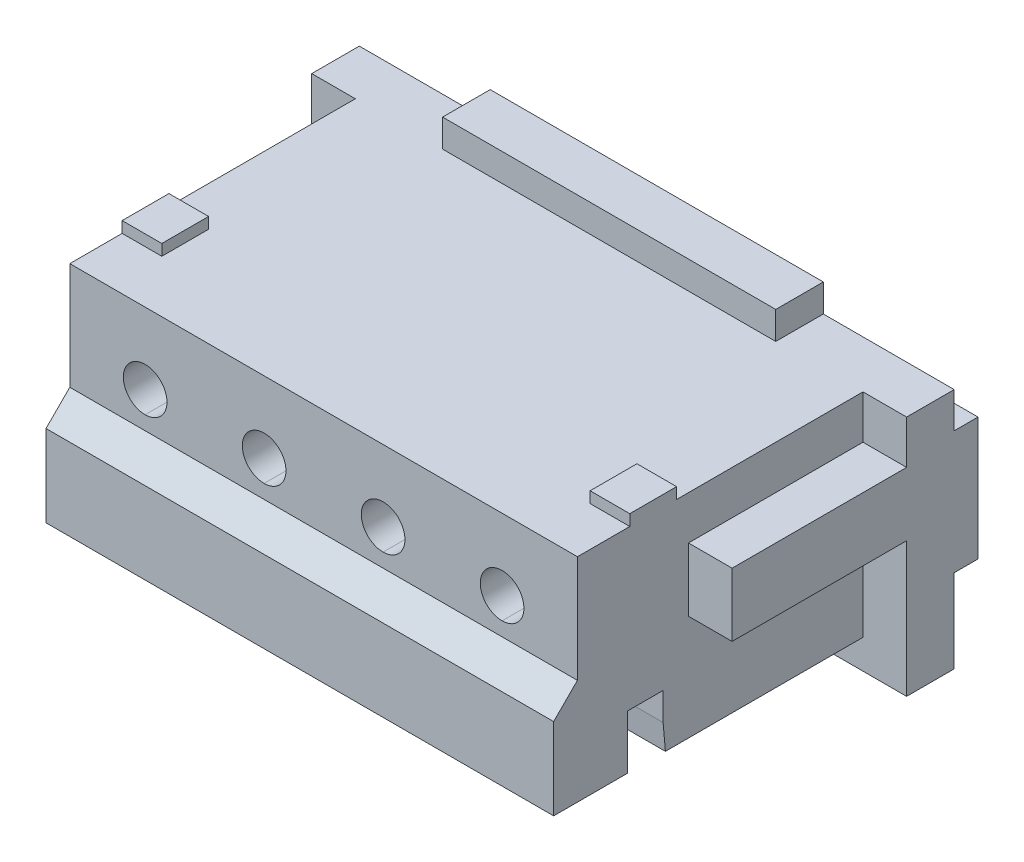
ISO-10303-21;
HEADER;
FILE_DESCRIPTION(('STEP AP214'),'2;1');
FILE_NAME('part.step','',(''),(''),'','','');
FILE_SCHEMA(('AUTOMOTIVE_DESIGN { 1 0 10303 214 1 1 1 1 }'));
ENDSEC;
DATA;
#1=APPLICATION_CONTEXT('core data for automotive mechanical design processes');
#2=APPLICATION_PROTOCOL_DEFINITION('international standard','automotive_design',2000,#1);
#3=PRODUCT_CONTEXT('',#1,'mechanical');
#4=PRODUCT('Part','Part','',(#3));
#5=PRODUCT_RELATED_PRODUCT_CATEGORY('part','',(#4));
#6=PRODUCT_DEFINITION_FORMATION('','',#4);
#7=PRODUCT_DEFINITION_CONTEXT('part definition',#1,'design');
#8=PRODUCT_DEFINITION('design','',#6,#7);
#9=PRODUCT_DEFINITION_SHAPE('','',#8);
#10=(LENGTH_UNIT() NAMED_UNIT(*) SI_UNIT(.MILLI.,.METRE.));
#11=(NAMED_UNIT(*) PLANE_ANGLE_UNIT() SI_UNIT($,.RADIAN.));
#12=(NAMED_UNIT(*) SI_UNIT($,.STERADIAN.) SOLID_ANGLE_UNIT());
#13=UNCERTAINTY_MEASURE_WITH_UNIT(LENGTH_MEASURE(1.E-05),#10,'distance_accuracy_value','');
#14=(GEOMETRIC_REPRESENTATION_CONTEXT(3) GLOBAL_UNCERTAINTY_ASSIGNED_CONTEXT((#13)) GLOBAL_UNIT_ASSIGNED_CONTEXT((#10,
#11,#12)) REPRESENTATION_CONTEXT('',''));
#15=CARTESIAN_POINT('',(0.,0.,0.));
#16=DIRECTION('',(0.,0.,1.));
#17=DIRECTION('',(1.,0.,0.));
#18=AXIS2_PLACEMENT_3D('',#15,#16,#17);
#19=CARTESIAN_POINT('',(-0.749999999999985,0.,0.500000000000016));
#20=DIRECTION('',(0.,0.,1.));
#21=DIRECTION('',(0.,-1.,0.));
#22=AXIS2_PLACEMENT_3D('',#19,#20,#21);
#23=PLANE('',#22);
#24=CARTESIAN_POINT('',(-0.749999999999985,0.,0.500000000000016));
#25=DIRECTION('',(0.,0.,1.));
#26=DIRECTION('',(0.,1.,0.));
#27=AXIS2_PLACEMENT_3D('',#24,#25,#26);
#28=CIRCLE('',#27,0.275);
#29=CARTESIAN_POINT('',(-0.749999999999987,0.274999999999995,0.500000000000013));
#30=VERTEX_POINT('',#29);
#31=CARTESIAN_POINT('',(-0.749999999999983,-0.275000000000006,0.500000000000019));
#32=VERTEX_POINT('',#31);
#33=EDGE_CURVE('E11',#30,#32,#28,.T.);
#34=ORIENTED_EDGE('',*,*,#33,.T.);
#35=CARTESIAN_POINT('',(-0.749999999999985,0.,0.500000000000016));
#36=DIRECTION('',(0.,0.,1.));
#37=DIRECTION('',(0.,1.,0.));
#38=AXIS2_PLACEMENT_3D('',#35,#36,#37);
#39=CIRCLE('',#38,0.275);
#40=EDGE_CURVE('E1060',#32,#30,#39,.T.);
#41=ORIENTED_EDGE('',*,*,#40,.T.);
#42=EDGE_LOOP('',(#34,#41));
#43=FACE_BOUND('',#42,.T.);
#44=ADVANCED_FACE('F18',(#43),#23,.T.);
#45=CARTESIAN_POINT('',(0.750000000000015,0.,0.500000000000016));
#46=DIRECTION('',(0.,0.,1.));
#47=DIRECTION('',(0.,-1.,0.));
#48=AXIS2_PLACEMENT_3D('',#45,#46,#47);
#49=PLANE('',#48);
#50=CARTESIAN_POINT('',(0.750000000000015,0.,0.500000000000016));
#51=DIRECTION('',(0.,0.,1.));
#52=DIRECTION('',(0.,1.,0.));
#53=AXIS2_PLACEMENT_3D('',#50,#51,#52);
#54=CIRCLE('',#53,0.275);
#55=CARTESIAN_POINT('',(0.750000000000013,0.275000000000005,0.500000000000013));
#56=VERTEX_POINT('',#55);
#57=CARTESIAN_POINT('',(0.750000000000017,-0.274999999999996,0.500000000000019));
#58=VERTEX_POINT('',#57);
#59=EDGE_CURVE('E1057',#56,#58,#54,.T.);
#60=ORIENTED_EDGE('',*,*,#59,.T.);
#61=CARTESIAN_POINT('',(0.750000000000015,0.,0.500000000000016));
#62=DIRECTION('',(0.,0.,1.));
#63=DIRECTION('',(0.,1.,0.));
#64=AXIS2_PLACEMENT_3D('',#61,#62,#63);
#65=CIRCLE('',#64,0.275);
#66=EDGE_CURVE('E1049',#58,#56,#65,.T.);
#67=ORIENTED_EDGE('',*,*,#66,.T.);
#68=EDGE_LOOP('',(#60,#67));
#69=FACE_BOUND('',#68,.T.);
#70=ADVANCED_FACE('F20',(#69),#49,.T.);
#71=CARTESIAN_POINT('',(-2.25,0.,0.500000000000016));
#72=DIRECTION('',(0.,0.,1.));
#73=DIRECTION('',(0.,-1.,0.));
#74=AXIS2_PLACEMENT_3D('',#71,#72,#73);
#75=PLANE('',#74);
#76=CARTESIAN_POINT('',(-2.25,0.,0.500000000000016));
#77=DIRECTION('',(0.,0.,1.));
#78=DIRECTION('',(0.,1.,0.));
#79=AXIS2_PLACEMENT_3D('',#76,#77,#78);
#80=CIRCLE('',#79,0.275);
#81=CARTESIAN_POINT('',(-2.25,0.274999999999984,0.500000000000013));
#82=VERTEX_POINT('',#81);
#83=CARTESIAN_POINT('',(-2.25,-0.275000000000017,0.500000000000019));
#84=VERTEX_POINT('',#83);
#85=EDGE_CURVE('E1046',#82,#84,#80,.T.);
#86=ORIENTED_EDGE('',*,*,#85,.T.);
#87=CARTESIAN_POINT('',(-2.25,0.,0.500000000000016));
#88=DIRECTION('',(0.,0.,1.));
#89=DIRECTION('',(0.,1.,0.));
#90=AXIS2_PLACEMENT_3D('',#87,#88,#89);
#91=CIRCLE('',#90,0.275);
#92=EDGE_CURVE('E1040',#84,#82,#91,.T.);
#93=ORIENTED_EDGE('',*,*,#92,.T.);
#94=EDGE_LOOP('',(#86,#93));
#95=FACE_BOUND('',#94,.T.);
#96=ADVANCED_FACE('F1609',(#95),#75,.T.);
#97=CARTESIAN_POINT('',(2.25,0.,0.500000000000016));
#98=DIRECTION('',(0.,0.,1.));
#99=DIRECTION('',(0.,-1.,0.));
#100=AXIS2_PLACEMENT_3D('',#97,#98,#99);
#101=PLANE('',#100);
#102=CARTESIAN_POINT('',(2.25,0.,0.500000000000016));
#103=DIRECTION('',(0.,0.,1.));
#104=DIRECTION('',(0.,1.,0.));
#105=AXIS2_PLACEMENT_3D('',#102,#103,#104);
#106=CIRCLE('',#105,0.275);
#107=CARTESIAN_POINT('',(2.25,0.275000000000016,0.500000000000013));
#108=VERTEX_POINT('',#107);
#109=CARTESIAN_POINT('',(2.25,-0.274999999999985,0.500000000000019));
#110=VERTEX_POINT('',#109);
#111=EDGE_CURVE('E1033',#108,#110,#106,.T.);
#112=ORIENTED_EDGE('',*,*,#111,.T.);
#113=CARTESIAN_POINT('',(2.25,0.,0.500000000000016));
#114=DIRECTION('',(0.,0.,1.));
#115=DIRECTION('',(0.,1.,0.));
#116=AXIS2_PLACEMENT_3D('',#113,#114,#115);
#117=CIRCLE('',#116,0.275);
#118=EDGE_CURVE('E740',#110,#108,#117,.T.);
#119=ORIENTED_EDGE('',*,*,#118,.T.);
#120=EDGE_LOOP('',(#112,#119));
#121=FACE_BOUND('',#120,.T.);
#122=ADVANCED_FACE('F1700',(#121),#101,.T.);
#123=CARTESIAN_POINT('',(-0.749999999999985,0.,0.500000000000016));
#124=DIRECTION('',(0.,0.,1.));
#125=DIRECTION('',(0.,1.,0.));
#126=AXIS2_PLACEMENT_3D('',#123,#124,#125);
#127=CYLINDRICAL_SURFACE('',#126,0.275);
#128=DIRECTION('',(0.,0.,1.));
#129=VECTOR('',#128,1.);
#130=CARTESIAN_POINT('',(-0.749999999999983,-0.275000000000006,0.500000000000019));
#131=LINE('',#130,#129);
#132=CARTESIAN_POINT('',(-0.749999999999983,-0.275,0.900000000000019));
#133=VERTEX_POINT('',#132);
#134=EDGE_CURVE('E1061',#32,#133,#131,.T.);
#135=ORIENTED_EDGE('',*,*,#134,.F.);
#136=ORIENTED_EDGE('',*,*,#33,.F.);
#137=DIRECTION('',(0.,0.,1.));
#138=VECTOR('',#137,1.);
#139=CARTESIAN_POINT('',(-0.749999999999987,0.274999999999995,0.500000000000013));
#140=LINE('',#139,#138);
#141=CARTESIAN_POINT('',(-0.749999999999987,0.275,0.900000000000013));
#142=VERTEX_POINT('',#141);
#143=EDGE_CURVE('E27',#30,#142,#140,.T.);
#144=ORIENTED_EDGE('',*,*,#143,.T.);
#145=CARTESIAN_POINT('',(-0.749999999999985,0.,0.900000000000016));
#146=DIRECTION('',(0.,0.,1.));
#147=DIRECTION('',(0.,1.,0.));
#148=AXIS2_PLACEMENT_3D('',#145,#146,#147);
#149=CIRCLE('',#148,0.275);
#150=EDGE_CURVE('E961',#142,#133,#149,.T.);
#151=ORIENTED_EDGE('',*,*,#150,.T.);
#152=EDGE_LOOP('',(#135,#136,#144,#151));
#153=FACE_BOUND('',#152,.T.);
#154=ADVANCED_FACE('F1065',(#153),#127,.F.);
#155=CARTESIAN_POINT('',(-0.749999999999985,0.,0.500000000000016));
#156=DIRECTION('',(0.,0.,1.));
#157=DIRECTION('',(0.,1.,0.));
#158=AXIS2_PLACEMENT_3D('',#155,#156,#157);
#159=CYLINDRICAL_SURFACE('',#158,0.275);
#160=ORIENTED_EDGE('',*,*,#40,.F.);
#161=ORIENTED_EDGE('',*,*,#134,.T.);
#162=CARTESIAN_POINT('',(-0.749999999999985,0.,0.900000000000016));
#163=DIRECTION('',(0.,0.,1.));
#164=DIRECTION('',(0.,1.,0.));
#165=AXIS2_PLACEMENT_3D('',#162,#163,#164);
#166=CIRCLE('',#165,0.275);
#167=EDGE_CURVE('E965',#133,#142,#166,.T.);
#168=ORIENTED_EDGE('',*,*,#167,.T.);
#169=ORIENTED_EDGE('',*,*,#143,.F.);
#170=EDGE_LOOP('',(#160,#161,#168,#169));
#171=FACE_BOUND('',#170,.T.);
#172=ADVANCED_FACE('F1070',(#171),#159,.F.);
#173=CARTESIAN_POINT('',(0.750000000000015,0.,0.500000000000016));
#174=DIRECTION('',(0.,0.,1.));
#175=DIRECTION('',(0.,1.,0.));
#176=AXIS2_PLACEMENT_3D('',#173,#174,#175);
#177=CYLINDRICAL_SURFACE('',#176,0.275);
#178=DIRECTION('',(0.,0.,1.));
#179=VECTOR('',#178,1.);
#180=CARTESIAN_POINT('',(0.750000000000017,-0.274999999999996,0.500000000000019));
#181=LINE('',#180,#179);
#182=CARTESIAN_POINT('',(0.750000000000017,-0.274999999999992,0.900000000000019));
#183=VERTEX_POINT('',#182);
#184=EDGE_CURVE('E1053',#58,#183,#181,.T.);
#185=ORIENTED_EDGE('',*,*,#184,.F.);
#186=ORIENTED_EDGE('',*,*,#59,.F.);
#187=DIRECTION('',(0.,0.,1.));
#188=VECTOR('',#187,1.);
#189=CARTESIAN_POINT('',(0.750000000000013,0.275000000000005,0.500000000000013));
#190=LINE('',#189,#188);
#191=CARTESIAN_POINT('',(0.750000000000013,0.275000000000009,0.900000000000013));
#192=VERTEX_POINT('',#191);
#193=EDGE_CURVE('E1056',#56,#192,#190,.T.);
#194=ORIENTED_EDGE('',*,*,#193,.T.);
#195=CARTESIAN_POINT('',(0.750000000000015,0.,0.900000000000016));
#196=DIRECTION('',(0.,0.,1.));
#197=DIRECTION('',(0.,1.,0.));
#198=AXIS2_PLACEMENT_3D('',#195,#196,#197);
#199=CIRCLE('',#198,0.275);
#200=EDGE_CURVE('E969',#192,#183,#199,.T.);
#201=ORIENTED_EDGE('',*,*,#200,.T.);
#202=EDGE_LOOP('',(#185,#186,#194,#201));
#203=FACE_BOUND('',#202,.T.);
#204=ADVANCED_FACE('F1652',(#203),#177,.F.);
#205=CARTESIAN_POINT('',(0.750000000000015,0.,0.500000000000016));
#206=DIRECTION('',(0.,0.,1.));
#207=DIRECTION('',(0.,1.,0.));
#208=AXIS2_PLACEMENT_3D('',#205,#206,#207);
#209=CYLINDRICAL_SURFACE('',#208,0.275);
#210=ORIENTED_EDGE('',*,*,#66,.F.);
#211=ORIENTED_EDGE('',*,*,#184,.T.);
#212=CARTESIAN_POINT('',(0.750000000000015,0.,0.900000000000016));
#213=DIRECTION('',(0.,0.,1.));
#214=DIRECTION('',(0.,1.,0.));
#215=AXIS2_PLACEMENT_3D('',#212,#213,#214);
#216=CIRCLE('',#215,0.275);
#217=EDGE_CURVE('E973',#183,#192,#216,.T.);
#218=ORIENTED_EDGE('',*,*,#217,.T.);
#219=ORIENTED_EDGE('',*,*,#193,.F.);
#220=EDGE_LOOP('',(#210,#211,#218,#219));
#221=FACE_BOUND('',#220,.T.);
#222=ADVANCED_FACE('F1648',(#221),#209,.F.);
#223=CARTESIAN_POINT('',(-2.25,0.,0.500000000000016));
#224=DIRECTION('',(0.,0.,1.));
#225=DIRECTION('',(0.,1.,0.));
#226=AXIS2_PLACEMENT_3D('',#223,#224,#225);
#227=CYLINDRICAL_SURFACE('',#226,0.275);
#228=DIRECTION('',(0.,0.,1.));
#229=VECTOR('',#228,1.);
#230=CARTESIAN_POINT('',(-2.25,-0.275000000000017,0.500000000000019));
#231=LINE('',#230,#229);
#232=CARTESIAN_POINT('',(-2.25,-0.275000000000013,0.900000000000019));
#233=VERTEX_POINT('',#232);
#234=EDGE_CURVE('E741',#84,#233,#231,.T.);
#235=ORIENTED_EDGE('',*,*,#234,.F.);
#236=ORIENTED_EDGE('',*,*,#85,.F.);
#237=DIRECTION('',(0.,0.,1.));
#238=VECTOR('',#237,1.);
#239=CARTESIAN_POINT('',(-2.25,0.274999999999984,0.500000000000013));
#240=LINE('',#239,#238);
#241=CARTESIAN_POINT('',(-2.25,0.274999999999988,0.900000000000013));
#242=VERTEX_POINT('',#241);
#243=EDGE_CURVE('E737',#82,#242,#240,.T.);
#244=ORIENTED_EDGE('',*,*,#243,.T.);
#245=CARTESIAN_POINT('',(-2.25,0.,0.900000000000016));
#246=DIRECTION('',(0.,0.,1.));
#247=DIRECTION('',(0.,1.,0.));
#248=AXIS2_PLACEMENT_3D('',#245,#246,#247);
#249=CIRCLE('',#248,0.275);
#250=EDGE_CURVE('E953',#242,#233,#249,.T.);
#251=ORIENTED_EDGE('',*,*,#250,.T.);
#252=EDGE_LOOP('',(#235,#236,#244,#251));
#253=FACE_BOUND('',#252,.T.);
#254=ADVANCED_FACE('F1651',(#253),#227,.F.);
#255=CARTESIAN_POINT('',(2.25,0.,0.500000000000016));
#256=DIRECTION('',(0.,0.,1.));
#257=DIRECTION('',(0.,1.,0.));
#258=AXIS2_PLACEMENT_3D('',#255,#256,#257);
#259=CYLINDRICAL_SURFACE('',#258,0.275);
#260=ORIENTED_EDGE('',*,*,#118,.F.);
#261=DIRECTION('',(0.,0.,1.));
#262=VECTOR('',#261,1.);
#263=CARTESIAN_POINT('',(2.25,-0.274999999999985,0.500000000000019));
#264=LINE('',#263,#262);
#265=CARTESIAN_POINT('',(2.25,-0.274999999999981,0.900000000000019));
#266=VERTEX_POINT('',#265);
#267=EDGE_CURVE('E1030',#110,#266,#264,.T.);
#268=ORIENTED_EDGE('',*,*,#267,.T.);
#269=CARTESIAN_POINT('',(2.25,0.,0.900000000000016));
#270=DIRECTION('',(0.,0.,1.));
#271=DIRECTION('',(0.,1.,0.));
#272=AXIS2_PLACEMENT_3D('',#269,#270,#271);
#273=CIRCLE('',#272,0.275);
#274=CARTESIAN_POINT('',(2.25,0.27500000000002,0.900000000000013));
#275=VERTEX_POINT('',#274);
#276=EDGE_CURVE('E981',#266,#275,#273,.T.);
#277=ORIENTED_EDGE('',*,*,#276,.T.);
#278=DIRECTION('',(0.,0.,1.));
#279=VECTOR('',#278,1.);
#280=CARTESIAN_POINT('',(2.25,0.275000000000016,0.500000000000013));
#281=LINE('',#280,#279);
#282=EDGE_CURVE('E1037',#108,#275,#281,.T.);
#283=ORIENTED_EDGE('',*,*,#282,.F.);
#284=EDGE_LOOP('',(#260,#268,#277,#283));
#285=FACE_BOUND('',#284,.T.);
#286=ADVANCED_FACE('F1655',(#285),#259,.F.);
#287=CARTESIAN_POINT('',(-2.25,0.,0.500000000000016));
#288=DIRECTION('',(0.,0.,1.));
#289=DIRECTION('',(0.,1.,0.));
#290=AXIS2_PLACEMENT_3D('',#287,#288,#289);
#291=CYLINDRICAL_SURFACE('',#290,0.275);
#292=ORIENTED_EDGE('',*,*,#92,.F.);
#293=ORIENTED_EDGE('',*,*,#234,.T.);
#294=CARTESIAN_POINT('',(-2.25,0.,0.900000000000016));
#295=DIRECTION('',(0.,0.,1.));
#296=DIRECTION('',(0.,1.,0.));
#297=AXIS2_PLACEMENT_3D('',#294,#295,#296);
#298=CIRCLE('',#297,0.275);
#299=EDGE_CURVE('E957',#233,#242,#298,.T.);
#300=ORIENTED_EDGE('',*,*,#299,.T.);
#301=ORIENTED_EDGE('',*,*,#243,.F.);
#302=EDGE_LOOP('',(#292,#293,#300,#301));
#303=FACE_BOUND('',#302,.T.);
#304=ADVANCED_FACE('F1687',(#303),#291,.F.);
#305=CARTESIAN_POINT('',(2.25,0.,0.500000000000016));
#306=DIRECTION('',(0.,0.,1.));
#307=DIRECTION('',(0.,1.,0.));
#308=AXIS2_PLACEMENT_3D('',#305,#306,#307);
#309=CYLINDRICAL_SURFACE('',#308,0.275);
#310=ORIENTED_EDGE('',*,*,#267,.F.);
#311=ORIENTED_EDGE('',*,*,#111,.F.);
#312=ORIENTED_EDGE('',*,*,#282,.T.);
#313=CARTESIAN_POINT('',(2.25,0.,0.900000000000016));
#314=DIRECTION('',(0.,0.,1.));
#315=DIRECTION('',(0.,1.,0.));
#316=AXIS2_PLACEMENT_3D('',#313,#314,#315);
#317=CIRCLE('',#316,0.275);
#318=EDGE_CURVE('E977',#275,#266,#317,.T.);
#319=ORIENTED_EDGE('',*,*,#318,.T.);
#320=EDGE_LOOP('',(#310,#311,#312,#319));
#321=FACE_BOUND('',#320,.T.);
#322=ADVANCED_FACE('F1683',(#321),#309,.F.);
#323=CARTESIAN_POINT('',(-3.75,-0.450000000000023,0.900000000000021));
#324=DIRECTION('',(0.,-0.707106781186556,-0.707106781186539));
#325=DIRECTION('',(0.,0.707106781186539,-0.707106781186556));
#326=AXIS2_PLACEMENT_3D('',#323,#324,#325);
#327=PLANE('',#326);
#328=DIRECTION('',(0.,0.707106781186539,-0.707106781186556));
#329=VECTOR('',#328,1.);
#330=CARTESIAN_POINT('',(3.2,-0.74999999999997,1.20000000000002));
#331=LINE('',#330,#329);
#332=CARTESIAN_POINT('',(3.2,-0.74999999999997,1.20000000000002));
#333=VERTEX_POINT('',#332);
#334=CARTESIAN_POINT('',(3.2,-0.449999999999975,0.900000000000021));
#335=VERTEX_POINT('',#334);
#336=EDGE_CURVE('E915',#333,#335,#331,.T.);
#337=ORIENTED_EDGE('',*,*,#336,.T.);
#338=DIRECTION('',(1.,0.,0.));
#339=VECTOR('',#338,1.);
#340=CARTESIAN_POINT('',(-3.75,-0.450000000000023,0.900000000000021));
#341=LINE('',#340,#339);
#342=CARTESIAN_POINT('',(-3.2,-0.450000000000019,0.900000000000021));
#343=VERTEX_POINT('',#342);
#344=EDGE_CURVE('E950',#343,#335,#341,.T.);
#345=ORIENTED_EDGE('',*,*,#344,.F.);
#346=DIRECTION('',(0.,0.707106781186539,-0.707106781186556));
#347=VECTOR('',#346,1.);
#348=CARTESIAN_POINT('',(-3.2,-0.750000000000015,1.20000000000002));
#349=LINE('',#348,#347);
#350=CARTESIAN_POINT('',(-3.2,-0.750000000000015,1.20000000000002));
#351=VERTEX_POINT('',#350);
#352=EDGE_CURVE('E833',#351,#343,#349,.T.);
#353=ORIENTED_EDGE('',*,*,#352,.F.);
#354=DIRECTION('',(1.,0.,0.));
#355=VECTOR('',#354,1.);
#356=CARTESIAN_POINT('',(-3.75,-0.750000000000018,1.20000000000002));
#357=LINE('',#356,#355);
#358=EDGE_CURVE('E1027',#351,#333,#357,.T.);
#359=ORIENTED_EDGE('',*,*,#358,.T.);
#360=EDGE_LOOP('',(#337,#345,#353,#359));
#361=FACE_BOUND('',#360,.T.);
#362=ADVANCED_FACE('F1679',(#361),#327,.F.);
#363=CARTESIAN_POINT('',(2.7,1.04000000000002,0.240000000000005));
#364=DIRECTION('',(0.,-1.,0.));
#365=DIRECTION('',(-1.,0.,0.));
#366=AXIS2_PLACEMENT_3D('',#363,#364,#365);
#367=PLANE('',#366);
#368=DIRECTION('',(0.,0.,-1.));
#369=VECTOR('',#368,1.);
#370=CARTESIAN_POINT('',(3.2,1.04000000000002,0.240000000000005));
#371=LINE('',#370,#369);
#372=CARTESIAN_POINT('',(3.2,1.04000000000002,0.240000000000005));
#373=VERTEX_POINT('',#372);
#374=CARTESIAN_POINT('',(3.2,1.04000000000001,-0.349999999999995));
#375=VERTEX_POINT('',#374);
#376=EDGE_CURVE('E879',#373,#375,#371,.T.);
#377=ORIENTED_EDGE('',*,*,#376,.T.);
#378=DIRECTION('',(1.,0.,0.));
#379=VECTOR('',#378,1.);
#380=CARTESIAN_POINT('',(2.7,1.04,-0.349999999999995));
#381=LINE('',#380,#379);
#382=CARTESIAN_POINT('',(2.7,1.04,-0.349999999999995));
#383=VERTEX_POINT('',#382);
#384=EDGE_CURVE('E944',#383,#375,#381,.T.);
#385=ORIENTED_EDGE('',*,*,#384,.F.);
#386=DIRECTION('',(0.,0.,-1.));
#387=VECTOR('',#386,1.);
#388=CARTESIAN_POINT('',(2.7,1.04000000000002,0.240000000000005));
#389=LINE('',#388,#387);
#390=CARTESIAN_POINT('',(2.7,1.04000000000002,0.240000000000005));
#391=VERTEX_POINT('',#390);
#392=EDGE_CURVE('E982',#391,#383,#389,.T.);
#393=ORIENTED_EDGE('',*,*,#392,.F.);
#394=DIRECTION('',(1.,0.,0.));
#395=VECTOR('',#394,1.);
#396=CARTESIAN_POINT('',(2.7,1.04000000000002,0.240000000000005));
#397=LINE('',#396,#395);
#398=EDGE_CURVE('E936',#391,#373,#397,.T.);
#399=ORIENTED_EDGE('',*,*,#398,.T.);
#400=EDGE_LOOP('',(#377,#385,#393,#399));
#401=FACE_BOUND('',#400,.T.);
#402=ADVANCED_FACE('F1682',(#401),#367,.F.);
#403=CARTESIAN_POINT('',(-3.75,-0.750000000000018,1.20000000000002));
#404=DIRECTION('',(0.,0.,-1.));
#405=DIRECTION('',(0.,-1.,0.));
#406=AXIS2_PLACEMENT_3D('',#403,#404,#405);
#407=PLANE('',#406);
#408=DIRECTION('',(0.,1.,0.));
#409=VECTOR('',#408,1.);
#410=CARTESIAN_POINT('',(3.2,-1.77999999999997,1.20000000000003));
#411=LINE('',#410,#409);
#412=CARTESIAN_POINT('',(3.2,-1.77999999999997,1.20000000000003));
#413=VERTEX_POINT('',#412);
#414=EDGE_CURVE('E919',#413,#333,#411,.T.);
#415=ORIENTED_EDGE('',*,*,#414,.T.);
#416=ORIENTED_EDGE('',*,*,#358,.F.);
#417=DIRECTION('',(0.,1.,0.));
#418=VECTOR('',#417,1.);
#419=CARTESIAN_POINT('',(-3.2,-1.78,1.20000000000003));
#420=LINE('',#419,#418);
#421=CARTESIAN_POINT('',(-3.2,-1.78,1.20000000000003));
#422=VERTEX_POINT('',#421);
#423=EDGE_CURVE('E837',#422,#351,#420,.T.);
#424=ORIENTED_EDGE('',*,*,#423,.F.);
#425=DIRECTION('',(1.,0.,0.));
#426=VECTOR('',#425,1.);
#427=CARTESIAN_POINT('',(-3.75,-1.78,1.20000000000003));
#428=LINE('',#427,#426);
#429=EDGE_CURVE('E1024',#422,#413,#428,.T.);
#430=ORIENTED_EDGE('',*,*,#429,.T.);
#431=EDGE_LOOP('',(#415,#416,#424,#430));
#432=FACE_BOUND('',#431,.T.);
#433=ADVANCED_FACE('F1677',(#432),#407,.F.);
#434=CARTESIAN_POINT('',(-3.75,-1.10000000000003,-0.180028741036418));
#435=DIRECTION('',(0.,-1.,0.));
#436=DIRECTION('',(-1.,0.,0.));
#437=AXIS2_PLACEMENT_3D('',#434,#435,#436);
#438=PLANE('',#437);
#439=DIRECTION('',(1.,0.,0.));
#440=VECTOR('',#439,1.);
#441=CARTESIAN_POINT('',(-3.75,-1.10000000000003,-0.180028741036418));
#442=LINE('',#441,#440);
#443=CARTESIAN_POINT('',(-3.2,-1.10000000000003,-0.180028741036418));
#444=VERTEX_POINT('',#443);
#445=CARTESIAN_POINT('',(3.2,-1.09999999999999,-0.180028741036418));
#446=VERTEX_POINT('',#445);
#447=EDGE_CURVE('E1023',#444,#446,#442,.T.);
#448=ORIENTED_EDGE('',*,*,#447,.T.);
#449=DIRECTION('',(0.,0.,1.));
#450=VECTOR('',#449,1.);
#451=CARTESIAN_POINT('',(3.2,-1.09999999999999,-0.180028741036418));
#452=LINE('',#451,#450);
#453=CARTESIAN_POINT('',(3.2,-1.09999999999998,0.269971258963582));
#454=VERTEX_POINT('',#453);
#455=EDGE_CURVE('E890',#446,#454,#452,.T.);
#456=ORIENTED_EDGE('',*,*,#455,.T.);
#457=DIRECTION('',(1.,0.,0.));
#458=VECTOR('',#457,1.);
#459=CARTESIAN_POINT('',(-3.75,-1.10000000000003,0.269971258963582));
#460=LINE('',#459,#458);
#461=CARTESIAN_POINT('',(-3.2,-1.10000000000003,0.269971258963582));
#462=VERTEX_POINT('',#461);
#463=EDGE_CURVE('E1014',#462,#454,#460,.T.);
#464=ORIENTED_EDGE('',*,*,#463,.F.);
#465=DIRECTION('',(0.,0.,1.));
#466=VECTOR('',#465,1.);
#467=CARTESIAN_POINT('',(-3.2,-1.10000000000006,-2.7));
#468=LINE('',#467,#466);
#469=EDGE_CURVE('E985',#444,#462,#468,.T.);
#470=ORIENTED_EDGE('',*,*,#469,.F.);
#471=EDGE_LOOP('',(#448,#456,#464,#470));
#472=FACE_BOUND('',#471,.T.);
#473=ADVANCED_FACE('F1673',(#472),#438,.T.);
#474=CARTESIAN_POINT('',(-3.75,-1.78,1.20000000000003));
#475=DIRECTION('',(0.,1.,0.));
#476=DIRECTION('',(0.,0.,-1.));
#477=AXIS2_PLACEMENT_3D('',#474,#475,#476);
#478=PLANE('',#477);
#479=DIRECTION('',(0.,0.,1.));
#480=VECTOR('',#479,1.);
#481=CARTESIAN_POINT('',(3.2,-1.77999999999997,1.20000000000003));
#482=LINE('',#481,#480);
#483=CARTESIAN_POINT('',(3.2,-1.78,0.269971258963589));
#484=VERTEX_POINT('',#483);
#485=EDGE_CURVE('E923',#484,#413,#482,.T.);
#486=ORIENTED_EDGE('',*,*,#485,.T.);
#487=ORIENTED_EDGE('',*,*,#429,.F.);
#488=DIRECTION('',(0.,0.,1.));
#489=VECTOR('',#488,1.);
#490=CARTESIAN_POINT('',(-3.2,-1.78,1.20000000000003));
#491=LINE('',#490,#489);
#492=CARTESIAN_POINT('',(-3.2,-1.78000000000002,0.269971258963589));
#493=VERTEX_POINT('',#492);
#494=EDGE_CURVE('E993',#493,#422,#491,.T.);
#495=ORIENTED_EDGE('',*,*,#494,.F.);
#496=DIRECTION('',(1.,0.,0.));
#497=VECTOR('',#496,1.);
#498=CARTESIAN_POINT('',(-3.75,-1.78000000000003,0.269971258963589));
#499=LINE('',#498,#497);
#500=EDGE_CURVE('E1017',#493,#484,#499,.T.);
#501=ORIENTED_EDGE('',*,*,#500,.T.);
#502=EDGE_LOOP('',(#486,#487,#495,#501));
#503=FACE_BOUND('',#502,.T.);
#504=ADVANCED_FACE('F1676',(#503),#478,.F.);
#505=CARTESIAN_POINT('',(-3.75,-1.45000000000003,-0.180028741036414));
#506=DIRECTION('',(0.,0.,1.));
#507=DIRECTION('',(0.,-1.,0.));
#508=AXIS2_PLACEMENT_3D('',#505,#506,#507);
#509=PLANE('',#508);
#510=DIRECTION('',(1.,0.,0.));
#511=VECTOR('',#510,1.);
#512=CARTESIAN_POINT('',(-3.75,-1.45000000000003,-0.180028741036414));
#513=LINE('',#512,#511);
#514=CARTESIAN_POINT('',(-3.2,-1.45000000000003,-0.180028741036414));
#515=VERTEX_POINT('',#514);
#516=CARTESIAN_POINT('',(3.2,-1.44999999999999,-0.180028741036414));
#517=VERTEX_POINT('',#516);
#518=EDGE_CURVE('E1020',#515,#517,#513,.T.);
#519=ORIENTED_EDGE('',*,*,#518,.T.);
#520=DIRECTION('',(0.,1.,0.));
#521=VECTOR('',#520,1.);
#522=CARTESIAN_POINT('',(3.2,-1.44999999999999,-0.180028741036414));
#523=LINE('',#522,#521);
#524=EDGE_CURVE('E894',#517,#446,#523,.T.);
#525=ORIENTED_EDGE('',*,*,#524,.T.);
#526=ORIENTED_EDGE('',*,*,#447,.F.);
#527=DIRECTION('',(0.,1.,0.));
#528=VECTOR('',#527,1.);
#529=CARTESIAN_POINT('',(-3.2,0.89999999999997,-0.180028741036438));
#530=LINE('',#529,#528);
#531=EDGE_CURVE('E1007',#515,#444,#530,.T.);
#532=ORIENTED_EDGE('',*,*,#531,.F.);
#533=EDGE_LOOP('',(#519,#525,#526,#532));
#534=FACE_BOUND('',#533,.T.);
#535=ADVANCED_FACE('F1671',(#534),#509,.T.);
#536=CARTESIAN_POINT('',(-3.75,-1.78000000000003,-0.208899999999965));
#537=DIRECTION('',(0.,-0.0871557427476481,0.996194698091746));
#538=DIRECTION('',(-1.,0.,0.));
#539=AXIS2_PLACEMENT_3D('',#536,#537,#538);
#540=PLANE('',#539);
#541=DIRECTION('',(1.,0.,0.));
#542=VECTOR('',#541,1.);
#543=CARTESIAN_POINT('',(-3.75,-1.78000000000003,-0.208899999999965));
#544=LINE('',#543,#542);
#545=CARTESIAN_POINT('',(-3.2,-1.78000000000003,-0.208899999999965));
#546=VERTEX_POINT('',#545);
#547=CARTESIAN_POINT('',(3.2,-1.78,-0.208899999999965));
#548=VERTEX_POINT('',#547);
#549=EDGE_CURVE('E1011',#546,#548,#544,.T.);
#550=ORIENTED_EDGE('',*,*,#549,.T.);
#551=DIRECTION('',(0.,0.996194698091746,0.0871557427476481));
#552=VECTOR('',#551,1.);
#553=CARTESIAN_POINT('',(3.2,-1.78,-0.208899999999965));
#554=LINE('',#553,#552);
#555=EDGE_CURVE('E898',#548,#517,#554,.T.);
#556=ORIENTED_EDGE('',*,*,#555,.T.);
#557=ORIENTED_EDGE('',*,*,#518,.F.);
#558=DIRECTION('',(0.,0.996194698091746,0.0871557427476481));
#559=VECTOR('',#558,1.);
#560=CARTESIAN_POINT('',(-3.2,0.663354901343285,0.00486585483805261));
#561=LINE('',#560,#559);
#562=EDGE_CURVE('E1006',#546,#515,#561,.T.);
#563=ORIENTED_EDGE('',*,*,#562,.F.);
#564=EDGE_LOOP('',(#550,#556,#557,#563));
#565=FACE_BOUND('',#564,.T.);
#566=ADVANCED_FACE('F1667',(#565),#540,.T.);
#567=CARTESIAN_POINT('',(-3.75,-1.10000000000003,0.269971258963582));
#568=DIRECTION('',(0.,0.,-1.));
#569=DIRECTION('',(0.,-1.,0.));
#570=AXIS2_PLACEMENT_3D('',#567,#568,#569);
#571=PLANE('',#570);
#572=ORIENTED_EDGE('',*,*,#463,.T.);
#573=DIRECTION('',(0.,-1.,0.));
#574=VECTOR('',#573,1.);
#575=CARTESIAN_POINT('',(3.2,-1.09999999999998,0.269971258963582));
#576=LINE('',#575,#574);
#577=EDGE_CURVE('E924',#454,#484,#576,.T.);
#578=ORIENTED_EDGE('',*,*,#577,.T.);
#579=ORIENTED_EDGE('',*,*,#500,.F.);
#580=DIRECTION('',(0.,-1.,0.));
#581=VECTOR('',#580,1.);
#582=CARTESIAN_POINT('',(-3.2,0.899999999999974,0.269971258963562));
#583=LINE('',#582,#581);
#584=EDGE_CURVE('E989',#462,#493,#583,.T.);
#585=ORIENTED_EDGE('',*,*,#584,.F.);
#586=EDGE_LOOP('',(#572,#578,#579,#585));
#587=FACE_BOUND('',#586,.T.);
#588=ADVANCED_FACE('F1663',(#587),#571,.T.);
#589=CARTESIAN_POINT('',(-2.7,1.03999999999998,0.240000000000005));
#590=DIRECTION('',(0.,1.,0.));
#591=DIRECTION('',(0.,0.,-1.));
#592=AXIS2_PLACEMENT_3D('',#589,#590,#591);
#593=PLANE('',#592);
#594=DIRECTION('',(0.,0.,-1.));
#595=VECTOR('',#594,1.);
#596=CARTESIAN_POINT('',(-3.2,1.03999999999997,0.240000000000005));
#597=LINE('',#596,#595);
#598=CARTESIAN_POINT('',(-3.2,1.03999999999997,0.240000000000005));
#599=VERTEX_POINT('',#598);
#600=CARTESIAN_POINT('',(-3.2,1.03999999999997,-0.349999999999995));
#601=VERTEX_POINT('',#600);
#602=EDGE_CURVE('E836',#599,#601,#597,.T.);
#603=ORIENTED_EDGE('',*,*,#602,.F.);
#604=DIRECTION('',(-1.,0.,0.));
#605=VECTOR('',#604,1.);
#606=CARTESIAN_POINT('',(-2.7,1.03999999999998,0.240000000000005));
#607=LINE('',#606,#605);
#608=CARTESIAN_POINT('',(-2.7,1.03999999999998,0.240000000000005));
#609=VERTEX_POINT('',#608);
#610=EDGE_CURVE('E932',#609,#599,#607,.T.);
#611=ORIENTED_EDGE('',*,*,#610,.F.);
#612=DIRECTION('',(0.,0.,-1.));
#613=VECTOR('',#612,1.);
#614=CARTESIAN_POINT('',(-2.7,1.03999999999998,0.240000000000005));
#615=LINE('',#614,#613);
#616=CARTESIAN_POINT('',(-2.7,1.03999999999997,-0.349999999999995));
#617=VERTEX_POINT('',#616);
#618=EDGE_CURVE('E883',#609,#617,#615,.T.);
#619=ORIENTED_EDGE('',*,*,#618,.T.);
#620=DIRECTION('',(-1.,0.,0.));
#621=VECTOR('',#620,1.);
#622=CARTESIAN_POINT('',(-2.7,1.03999999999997,-0.349999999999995));
#623=LINE('',#622,#621);
#624=EDGE_CURVE('E871',#617,#601,#623,.T.);
#625=ORIENTED_EDGE('',*,*,#624,.T.);
#626=EDGE_LOOP('',(#603,#611,#619,#625));
#627=FACE_BOUND('',#626,.T.);
#628=ADVANCED_FACE('F1624',(#627),#593,.T.);
#629=CARTESIAN_POINT('',(-3.75,-1.78,1.20000000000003));
#630=DIRECTION('',(0.,1.,0.));
#631=DIRECTION('',(0.,0.,-1.));
#632=AXIS2_PLACEMENT_3D('',#629,#630,#631);
#633=PLANE('',#632);
#634=DIRECTION('',(0.,0.,1.));
#635=VECTOR('',#634,1.);
#636=CARTESIAN_POINT('',(3.2,-1.77999999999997,1.20000000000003));
#637=LINE('',#636,#635);
#638=CARTESIAN_POINT('',(3.2,-1.78,-2.69999999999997));
#639=VERTEX_POINT('',#638);
#640=EDGE_CURVE('E880',#639,#548,#637,.T.);
#641=ORIENTED_EDGE('',*,*,#640,.T.);
#642=ORIENTED_EDGE('',*,*,#549,.F.);
#643=DIRECTION('',(0.,0.,1.));
#644=VECTOR('',#643,1.);
#645=CARTESIAN_POINT('',(-3.2,-1.78,1.20000000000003));
#646=LINE('',#645,#644);
#647=CARTESIAN_POINT('',(-3.2,-1.78000000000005,-2.69999999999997));
#648=VERTEX_POINT('',#647);
#649=EDGE_CURVE('E1002',#648,#546,#646,.T.);
#650=ORIENTED_EDGE('',*,*,#649,.F.);
#651=DIRECTION('',(1.,0.,0.));
#652=VECTOR('',#651,1.);
#653=CARTESIAN_POINT('',(-3.75,-1.78000000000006,-2.69999999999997));
#654=LINE('',#653,#652);
#655=EDGE_CURVE('E821',#648,#639,#654,.T.);
#656=ORIENTED_EDGE('',*,*,#655,.T.);
#657=EDGE_LOOP('',(#641,#642,#650,#656));
#658=FACE_BOUND('',#657,.T.);
#659=ADVANCED_FACE('F1620',(#658),#633,.F.);
#660=CARTESIAN_POINT('',(-3.2,0.899999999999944,-2.7));
#661=DIRECTION('',(-1.,0.,0.));
#662=DIRECTION('',(0.,1.,0.));
#663=AXIS2_PLACEMENT_3D('',#660,#661,#662);
#664=PLANE('',#663);
#665=ORIENTED_EDGE('',*,*,#469,.T.);
#666=ORIENTED_EDGE('',*,*,#584,.T.);
#667=ORIENTED_EDGE('',*,*,#494,.T.);
#668=ORIENTED_EDGE('',*,*,#423,.T.);
#669=ORIENTED_EDGE('',*,*,#352,.T.);
#670=DIRECTION('',(0.,1.,0.));
#671=VECTOR('',#670,1.);
#672=CARTESIAN_POINT('',(-3.2,-0.450000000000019,0.900000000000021));
#673=LINE('',#672,#671);
#674=CARTESIAN_POINT('',(-3.2,0.899999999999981,0.9));
#675=VERTEX_POINT('',#674);
#676=EDGE_CURVE('E947',#343,#675,#673,.T.);
#677=ORIENTED_EDGE('',*,*,#676,.T.);
#678=DIRECTION('',(0.,0.,-1.));
#679=VECTOR('',#678,1.);
#680=CARTESIAN_POINT('',(-3.2,0.899999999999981,0.9));
#681=LINE('',#680,#679);
#682=CARTESIAN_POINT('',(-3.2,0.899999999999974,0.240000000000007));
#683=VERTEX_POINT('',#682);
#684=EDGE_CURVE('E775',#675,#683,#681,.T.);
#685=ORIENTED_EDGE('',*,*,#684,.T.);
#686=DIRECTION('',(0.,1.,0.));
#687=VECTOR('',#686,1.);
#688=CARTESIAN_POINT('',(-3.2,0.899999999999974,0.240000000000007));
#689=LINE('',#688,#687);
#690=EDGE_CURVE('E928',#683,#599,#689,.T.);
#691=ORIENTED_EDGE('',*,*,#690,.T.);
#692=ORIENTED_EDGE('',*,*,#602,.T.);
#693=DIRECTION('',(0.,-1.,0.));
#694=VECTOR('',#693,1.);
#695=CARTESIAN_POINT('',(-3.2,0.899999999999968,-0.349999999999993));
#696=LINE('',#695,#694);
#697=CARTESIAN_POINT('',(-3.2,0.899999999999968,-0.349999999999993));
#698=VERTEX_POINT('',#697);
#699=EDGE_CURVE('E868',#601,#698,#696,.T.);
#700=ORIENTED_EDGE('',*,*,#699,.T.);
#701=DIRECTION('',(0.,0.,-1.));
#702=VECTOR('',#701,1.);
#703=CARTESIAN_POINT('',(-3.2,0.899999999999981,0.9));
#704=LINE('',#703,#702);
#705=CARTESIAN_POINT('',(-3.2,0.899999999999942,-2.7));
#706=VERTEX_POINT('',#705);
#707=EDGE_CURVE('E765',#698,#706,#704,.T.);
#708=ORIENTED_EDGE('',*,*,#707,.T.);
#709=DIRECTION('',(0.,-1.,0.));
#710=VECTOR('',#709,1.);
#711=CARTESIAN_POINT('',(-3.2,0.899999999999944,-2.7));
#712=LINE('',#711,#710);
#713=CARTESIAN_POINT('',(-3.2,0.349999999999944,-2.7));
#714=VERTEX_POINT('',#713);
#715=EDGE_CURVE('E855',#706,#714,#712,.T.);
#716=ORIENTED_EDGE('',*,*,#715,.T.);
#717=DIRECTION('',(0.,0.,1.));
#718=VECTOR('',#717,1.);
#719=CARTESIAN_POINT('',(-3.2,0.349999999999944,-2.7));
#720=LINE('',#719,#718);
#721=CARTESIAN_POINT('',(-3.2,0.349999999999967,-0.499999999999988));
#722=VERTEX_POINT('',#721);
#723=EDGE_CURVE('E851',#714,#722,#720,.T.);
#724=ORIENTED_EDGE('',*,*,#723,.T.);
#725=DIRECTION('',(0.,-1.,0.));
#726=VECTOR('',#725,1.);
#727=CARTESIAN_POINT('',(-3.2,-0.450000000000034,-0.49999999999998));
#728=LINE('',#727,#726);
#729=CARTESIAN_POINT('',(-3.2,-0.450000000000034,-0.49999999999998));
#730=VERTEX_POINT('',#729);
#731=EDGE_CURVE('E840',#722,#730,#728,.T.);
#732=ORIENTED_EDGE('',*,*,#731,.T.);
#733=DIRECTION('',(0.,0.,-1.));
#734=VECTOR('',#733,1.);
#735=CARTESIAN_POINT('',(-3.2,-0.450000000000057,-2.7));
#736=LINE('',#735,#734);
#737=CARTESIAN_POINT('',(-3.2,-0.450000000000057,-2.7));
#738=VERTEX_POINT('',#737);
#739=EDGE_CURVE('E829',#730,#738,#736,.T.);
#740=ORIENTED_EDGE('',*,*,#739,.T.);
#741=DIRECTION('',(0.,-1.,0.));
#742=VECTOR('',#741,1.);
#743=CARTESIAN_POINT('',(-3.2,-1.78000000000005,-2.69999999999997));
#744=LINE('',#743,#742);
#745=EDGE_CURVE('E825',#738,#648,#744,.T.);
#746=ORIENTED_EDGE('',*,*,#745,.T.);
#747=ORIENTED_EDGE('',*,*,#649,.T.);
#748=ORIENTED_EDGE('',*,*,#562,.T.);
#749=ORIENTED_EDGE('',*,*,#531,.T.);
#750=EDGE_LOOP('',(#665,#666,#667,#668,#669,#677,#685,#691,#692,#700,#708,#716,#724,#732,#740,
#746,#747,#748,#749));
#751=FACE_BOUND('',#750,.T.);
#752=ADVANCED_FACE('F1623',(#751),#664,.T.);
#753=CARTESIAN_POINT('',(2.7,0.90000000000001,-0.349999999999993));
#754=DIRECTION('',(-1.,0.,0.));
#755=DIRECTION('',(0.,1.,0.));
#756=AXIS2_PLACEMENT_3D('',#753,#754,#755);
#757=PLANE('',#756);
#758=DIRECTION('',(0.,0.,1.));
#759=VECTOR('',#758,1.);
#760=CARTESIAN_POINT('',(2.7,0.900000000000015,0.240000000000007));
#761=LINE('',#760,#759);
#762=CARTESIAN_POINT('',(2.7,0.9,-0.349999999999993));
#763=VERTEX_POINT('',#762);
#764=CARTESIAN_POINT('',(2.7,0.900000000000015,0.240000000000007));
#765=VERTEX_POINT('',#764);
#766=EDGE_CURVE('E664',#763,#765,#761,.T.);
#767=ORIENTED_EDGE('',*,*,#766,.T.);
#768=DIRECTION('',(0.,1.,0.));
#769=VECTOR('',#768,1.);
#770=CARTESIAN_POINT('',(2.7,0.900000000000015,0.240000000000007));
#771=LINE('',#770,#769);
#772=EDGE_CURVE('E939',#765,#391,#771,.T.);
#773=ORIENTED_EDGE('',*,*,#772,.T.);
#774=ORIENTED_EDGE('',*,*,#392,.T.);
#775=DIRECTION('',(0.,-1.,0.));
#776=VECTOR('',#775,1.);
#777=CARTESIAN_POINT('',(2.7,0.90000000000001,-0.349999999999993));
#778=LINE('',#777,#776);
#779=EDGE_CURVE('E943',#383,#763,#778,.T.);
#780=ORIENTED_EDGE('',*,*,#779,.T.);
#781=EDGE_LOOP('',(#767,#773,#774,#780));
#782=FACE_BOUND('',#781,.T.);
#783=ADVANCED_FACE('F1076',(#782),#757,.T.);
#784=CARTESIAN_POINT('',(-3.75,0.899999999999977,0.9));
#785=DIRECTION('',(0.,0.,-1.));
#786=DIRECTION('',(0.,-1.,0.));
#787=AXIS2_PLACEMENT_3D('',#784,#785,#786);
#788=PLANE('',#787);
#789=ORIENTED_EDGE('',*,*,#318,.F.);
#790=ORIENTED_EDGE('',*,*,#276,.F.);
#791=EDGE_LOOP('',(#789,#790));
#792=FACE_BOUND('',#791,.T.);
#793=ORIENTED_EDGE('',*,*,#200,.F.);
#794=ORIENTED_EDGE('',*,*,#217,.F.);
#795=EDGE_LOOP('',(#793,#794));
#796=FACE_BOUND('',#795,.T.);
#797=ORIENTED_EDGE('',*,*,#150,.F.);
#798=ORIENTED_EDGE('',*,*,#167,.F.);
#799=EDGE_LOOP('',(#797,#798));
#800=FACE_BOUND('',#799,.T.);
#801=ORIENTED_EDGE('',*,*,#250,.F.);
#802=ORIENTED_EDGE('',*,*,#299,.F.);
#803=EDGE_LOOP('',(#801,#802));
#804=FACE_BOUND('',#803,.T.);
#805=DIRECTION('',(0.,1.,0.));
#806=VECTOR('',#805,1.);
#807=CARTESIAN_POINT('',(3.2,-0.449999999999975,0.900000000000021));
#808=LINE('',#807,#806);
#809=CARTESIAN_POINT('',(3.2,0.900000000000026,0.9));
#810=VERTEX_POINT('',#809);
#811=EDGE_CURVE('E912',#335,#810,#808,.T.);
#812=ORIENTED_EDGE('',*,*,#811,.T.);
#813=DIRECTION('',(1.,0.,0.));
#814=VECTOR('',#813,1.);
#815=CARTESIAN_POINT('',(-3.75,0.899999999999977,0.9));
#816=LINE('',#815,#814);
#817=EDGE_CURVE('E779',#675,#810,#816,.T.);
#818=ORIENTED_EDGE('',*,*,#817,.F.);
#819=ORIENTED_EDGE('',*,*,#676,.F.);
#820=ORIENTED_EDGE('',*,*,#344,.T.);
#821=EDGE_LOOP('',(#812,#818,#819,#820));
#822=FACE_BOUND('',#821,.T.);
#823=ADVANCED_FACE('F1072',(#792,#796,#800,#804,#822),#788,.F.);
#824=CARTESIAN_POINT('',(2.7,0.90000000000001,-0.349999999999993));
#825=DIRECTION('',(0.,0.,1.));
#826=DIRECTION('',(0.,-1.,0.));
#827=AXIS2_PLACEMENT_3D('',#824,#825,#826);
#828=PLANE('',#827);
#829=DIRECTION('',(0.,-1.,0.));
#830=VECTOR('',#829,1.);
#831=CARTESIAN_POINT('',(3.2,0.900000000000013,-0.349999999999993));
#832=LINE('',#831,#830);
#833=CARTESIAN_POINT('',(3.2,0.900000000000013,-0.349999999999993));
#834=VERTEX_POINT('',#833);
#835=EDGE_CURVE('E876',#375,#834,#832,.T.);
#836=ORIENTED_EDGE('',*,*,#835,.T.);
#837=DIRECTION('',(1.,0.,0.));
#838=VECTOR('',#837,1.);
#839=CARTESIAN_POINT('',(2.7,0.90000000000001,-0.349999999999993));
#840=LINE('',#839,#838);
#841=EDGE_CURVE('E674',#763,#834,#840,.T.);
#842=ORIENTED_EDGE('',*,*,#841,.F.);
#843=ORIENTED_EDGE('',*,*,#779,.F.);
#844=ORIENTED_EDGE('',*,*,#384,.T.);
#845=EDGE_LOOP('',(#836,#842,#843,#844));
#846=FACE_BOUND('',#845,.T.);
#847=ADVANCED_FACE('F1075',(#846),#828,.F.);
#848=CARTESIAN_POINT('',(2.7,0.900000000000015,0.240000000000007));
#849=DIRECTION('',(0.,0.,-1.));
#850=DIRECTION('',(0.,-1.,0.));
#851=AXIS2_PLACEMENT_3D('',#848,#849,#850);
#852=PLANE('',#851);
#853=DIRECTION('',(0.,1.,0.));
#854=VECTOR('',#853,1.);
#855=CARTESIAN_POINT('',(3.2,0.900000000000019,0.240000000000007));
#856=LINE('',#855,#854);
#857=CARTESIAN_POINT('',(3.2,0.900000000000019,0.240000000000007));
#858=VERTEX_POINT('',#857);
#859=EDGE_CURVE('E908',#858,#373,#856,.T.);
#860=ORIENTED_EDGE('',*,*,#859,.T.);
#861=ORIENTED_EDGE('',*,*,#398,.F.);
#862=ORIENTED_EDGE('',*,*,#772,.F.);
#863=DIRECTION('',(1.,0.,0.));
#864=VECTOR('',#863,1.);
#865=CARTESIAN_POINT('',(2.7,0.900000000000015,0.240000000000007));
#866=LINE('',#865,#864);
#867=EDGE_CURVE('E660',#765,#858,#866,.T.);
#868=ORIENTED_EDGE('',*,*,#867,.T.);
#869=EDGE_LOOP('',(#860,#861,#862,#868));
#870=FACE_BOUND('',#869,.T.);
#871=ADVANCED_FACE('F1646',(#870),#852,.F.);
#872=CARTESIAN_POINT('',(-2.7,0.899999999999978,0.240000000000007));
#873=DIRECTION('',(0.,0.,1.));
#874=DIRECTION('',(0.,-1.,0.));
#875=AXIS2_PLACEMENT_3D('',#872,#873,#874);
#876=PLANE('',#875);
#877=ORIENTED_EDGE('',*,*,#690,.F.);
#878=DIRECTION('',(-1.,0.,0.));
#879=VECTOR('',#878,1.);
#880=CARTESIAN_POINT('',(-2.7,0.899999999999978,0.240000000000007));
#881=LINE('',#880,#879);
#882=CARTESIAN_POINT('',(-2.7,0.899999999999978,0.240000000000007));
#883=VERTEX_POINT('',#882);
#884=EDGE_CURVE('E774',#883,#683,#881,.T.);
#885=ORIENTED_EDGE('',*,*,#884,.F.);
#886=DIRECTION('',(0.,1.,0.));
#887=VECTOR('',#886,1.);
#888=CARTESIAN_POINT('',(-2.7,0.899999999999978,0.240000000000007));
#889=LINE('',#888,#887);
#890=EDGE_CURVE('E886',#883,#609,#889,.T.);
#891=ORIENTED_EDGE('',*,*,#890,.T.);
#892=ORIENTED_EDGE('',*,*,#610,.T.);
#893=EDGE_LOOP('',(#877,#885,#891,#892));
#894=FACE_BOUND('',#893,.T.);
#895=ADVANCED_FACE('F1643',(#894),#876,.T.);
#896=CARTESIAN_POINT('',(3.2,0.899999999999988,-2.7));
#897=DIRECTION('',(1.,0.,0.));
#898=DIRECTION('',(0.,1.,0.));
#899=AXIS2_PLACEMENT_3D('',#896,#897,#898);
#900=PLANE('',#899);
#901=ORIENTED_EDGE('',*,*,#455,.F.);
#902=ORIENTED_EDGE('',*,*,#524,.F.);
#903=ORIENTED_EDGE('',*,*,#555,.F.);
#904=ORIENTED_EDGE('',*,*,#640,.F.);
#905=DIRECTION('',(0.,-1.,0.));
#906=VECTOR('',#905,1.);
#907=CARTESIAN_POINT('',(3.2,-1.78,-2.69999999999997));
#908=LINE('',#907,#906);
#909=CARTESIAN_POINT('',(3.2,-0.450000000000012,-2.7));
#910=VERTEX_POINT('',#909);
#911=EDGE_CURVE('E820',#910,#639,#908,.T.);
#912=ORIENTED_EDGE('',*,*,#911,.F.);
#913=DIRECTION('',(0.,0.,-1.));
#914=VECTOR('',#913,1.);
#915=CARTESIAN_POINT('',(3.2,-0.450000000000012,-2.7));
#916=LINE('',#915,#914);
#917=CARTESIAN_POINT('',(3.2,-0.449999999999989,-0.49999999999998));
#918=VERTEX_POINT('',#917);
#919=EDGE_CURVE('E844',#918,#910,#916,.T.);
#920=ORIENTED_EDGE('',*,*,#919,.F.);
#921=DIRECTION('',(0.,-1.,0.));
#922=VECTOR('',#921,1.);
#923=CARTESIAN_POINT('',(3.2,-0.449999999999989,-0.49999999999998));
#924=LINE('',#923,#922);
#925=CARTESIAN_POINT('',(3.2,0.350000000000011,-0.499999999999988));
#926=VERTEX_POINT('',#925);
#927=EDGE_CURVE('E845',#926,#918,#924,.T.);
#928=ORIENTED_EDGE('',*,*,#927,.F.);
#929=DIRECTION('',(0.,0.,1.));
#930=VECTOR('',#929,1.);
#931=CARTESIAN_POINT('',(3.2,0.349999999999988,-2.7));
#932=LINE('',#931,#930);
#933=CARTESIAN_POINT('',(3.2,0.349999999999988,-2.7));
#934=VERTEX_POINT('',#933);
#935=EDGE_CURVE('E750',#934,#926,#932,.T.);
#936=ORIENTED_EDGE('',*,*,#935,.F.);
#937=DIRECTION('',(0.,-1.,0.));
#938=VECTOR('',#937,1.);
#939=CARTESIAN_POINT('',(3.2,0.899999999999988,-2.7));
#940=LINE('',#939,#938);
#941=CARTESIAN_POINT('',(3.2,0.899999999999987,-2.7));
#942=VERTEX_POINT('',#941);
#943=EDGE_CURVE('E751',#942,#934,#940,.T.);
#944=ORIENTED_EDGE('',*,*,#943,.F.);
#945=DIRECTION('',(0.,0.,-1.));
#946=VECTOR('',#945,1.);
#947=CARTESIAN_POINT('',(3.2,0.900000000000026,0.9));
#948=LINE('',#947,#946);
#949=EDGE_CURVE('E669',#834,#942,#948,.T.);
#950=ORIENTED_EDGE('',*,*,#949,.F.);
#951=ORIENTED_EDGE('',*,*,#835,.F.);
#952=ORIENTED_EDGE('',*,*,#376,.F.);
#953=ORIENTED_EDGE('',*,*,#859,.F.);
#954=DIRECTION('',(0.,0.,-1.));
#955=VECTOR('',#954,1.);
#956=CARTESIAN_POINT('',(3.2,0.900000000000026,0.9));
#957=LINE('',#956,#955);
#958=EDGE_CURVE('E785',#810,#858,#957,.T.);
#959=ORIENTED_EDGE('',*,*,#958,.F.);
#960=ORIENTED_EDGE('',*,*,#811,.F.);
#961=ORIENTED_EDGE('',*,*,#336,.F.);
#962=ORIENTED_EDGE('',*,*,#414,.F.);
#963=ORIENTED_EDGE('',*,*,#485,.F.);
#964=ORIENTED_EDGE('',*,*,#577,.F.);
#965=EDGE_LOOP('',(#901,#902,#903,#904,#912,#920,#928,#936,#944,#950,#951,#952,#953,#959,#960,
#961,#962,#963,#964));
#966=FACE_BOUND('',#965,.T.);
#967=ADVANCED_FACE('F1093',(#966),#900,.T.);
#968=CARTESIAN_POINT('',(-2.7,0.899999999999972,-0.349999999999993));
#969=DIRECTION('',(1.,0.,0.));
#970=DIRECTION('',(0.,1.,0.));
#971=AXIS2_PLACEMENT_3D('',#968,#969,#970);
#972=PLANE('',#971);
#973=DIRECTION('',(0.,0.,1.));
#974=VECTOR('',#973,1.);
#975=CARTESIAN_POINT('',(-2.7,0.899999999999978,0.240000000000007));
#976=LINE('',#975,#974);
#977=CARTESIAN_POINT('',(-2.7,0.899999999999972,-0.349999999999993));
#978=VERTEX_POINT('',#977);
#979=EDGE_CURVE('E770',#978,#883,#976,.T.);
#980=ORIENTED_EDGE('',*,*,#979,.F.);
#981=DIRECTION('',(0.,-1.,0.));
#982=VECTOR('',#981,1.);
#983=CARTESIAN_POINT('',(-2.7,0.899999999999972,-0.349999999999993));
#984=LINE('',#983,#982);
#985=EDGE_CURVE('E875',#617,#978,#984,.T.);
#986=ORIENTED_EDGE('',*,*,#985,.F.);
#987=ORIENTED_EDGE('',*,*,#618,.F.);
#988=ORIENTED_EDGE('',*,*,#890,.F.);
#989=EDGE_LOOP('',(#980,#986,#987,#988));
#990=FACE_BOUND('',#989,.T.);
#991=ADVANCED_FACE('F1638',(#990),#972,.T.);
#992=CARTESIAN_POINT('',(-2.7,0.899999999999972,-0.349999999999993));
#993=DIRECTION('',(0.,0.,-1.));
#994=DIRECTION('',(0.,-1.,0.));
#995=AXIS2_PLACEMENT_3D('',#992,#993,#994);
#996=PLANE('',#995);
#997=ORIENTED_EDGE('',*,*,#699,.F.);
#998=ORIENTED_EDGE('',*,*,#624,.F.);
#999=ORIENTED_EDGE('',*,*,#985,.T.);
#1000=DIRECTION('',(-1.,0.,0.));
#1001=VECTOR('',#1000,1.);
#1002=CARTESIAN_POINT('',(-2.7,0.899999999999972,-0.349999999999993));
#1003=LINE('',#1002,#1001);
#1004=EDGE_CURVE('E769',#978,#698,#1003,.T.);
#1005=ORIENTED_EDGE('',*,*,#1004,.T.);
#1006=EDGE_LOOP('',(#997,#998,#999,#1005));
#1007=FACE_BOUND('',#1006,.T.);
#1008=ADVANCED_FACE('F1641',(#1007),#996,.T.);
#1009=CARTESIAN_POINT('',(-3.75,1.24999999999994,-2.7));
#1010=DIRECTION('',(0.,0.,-1.));
#1011=DIRECTION('',(0.,-1.,0.));
#1012=AXIS2_PLACEMENT_3D('',#1009,#1010,#1011);
#1013=PLANE('',#1012);
#1014=DIRECTION('',(0.,1.,0.));
#1015=VECTOR('',#1014,1.);
#1016=CARTESIAN_POINT('',(2.1,0.899999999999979,-2.7));
#1017=LINE('',#1016,#1015);
#1018=CARTESIAN_POINT('',(2.1,0.899999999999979,-2.7));
#1019=VERTEX_POINT('',#1018);
#1020=CARTESIAN_POINT('',(2.1,1.24999999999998,-2.7));
#1021=VERTEX_POINT('',#1020);
#1022=EDGE_CURVE('E735',#1019,#1021,#1017,.T.);
#1023=ORIENTED_EDGE('',*,*,#1022,.T.);
#1024=DIRECTION('',(1.,0.,0.));
#1025=VECTOR('',#1024,1.);
#1026=CARTESIAN_POINT('',(-3.75,1.24999999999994,-2.7));
#1027=LINE('',#1026,#1025);
#1028=CARTESIAN_POINT('',(-2.1,1.24999999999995,-2.7));
#1029=VERTEX_POINT('',#1028);
#1030=EDGE_CURVE('E731',#1029,#1021,#1027,.T.);
#1031=ORIENTED_EDGE('',*,*,#1030,.F.);
#1032=DIRECTION('',(0.,1.,0.));
#1033=VECTOR('',#1032,1.);
#1034=CARTESIAN_POINT('',(-2.1,0.89999999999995,-2.7));
#1035=LINE('',#1034,#1033);
#1036=CARTESIAN_POINT('',(-2.1,0.89999999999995,-2.7));
#1037=VERTEX_POINT('',#1036);
#1038=EDGE_CURVE('E745',#1037,#1029,#1035,.T.);
#1039=ORIENTED_EDGE('',*,*,#1038,.F.);
#1040=DIRECTION('',(1.,0.,0.));
#1041=VECTOR('',#1040,1.);
#1042=CARTESIAN_POINT('',(-3.75,0.89999999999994,-2.7));
#1043=LINE('',#1042,#1041);
#1044=EDGE_CURVE('E761',#1037,#1019,#1043,.T.);
#1045=ORIENTED_EDGE('',*,*,#1044,.T.);
#1046=EDGE_LOOP('',(#1023,#1031,#1039,#1045));
#1047=FACE_BOUND('',#1046,.T.);
#1048=ADVANCED_FACE('F1882',(#1047),#1013,.F.);
#1049=CARTESIAN_POINT('',(3.2,0.349999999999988,-2.7));
#1050=DIRECTION('',(0.,1.,0.));
#1051=DIRECTION('',(0.,0.,-1.));
#1052=AXIS2_PLACEMENT_3D('',#1049,#1050,#1051);
#1053=PLANE('',#1052);
#1054=DIRECTION('',(0.,0.,1.));
#1055=VECTOR('',#1054,1.);
#1056=CARTESIAN_POINT('',(3.75,0.349999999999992,-2.7));
#1057=LINE('',#1056,#1055);
#1058=CARTESIAN_POINT('',(3.75,0.349999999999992,-2.7));
#1059=VERTEX_POINT('',#1058);
#1060=CARTESIAN_POINT('',(3.75,0.350000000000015,-0.499999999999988));
#1061=VERTEX_POINT('',#1060);
#1062=EDGE_CURVE('E703',#1059,#1061,#1057,.T.);
#1063=ORIENTED_EDGE('',*,*,#1062,.F.);
#1064=DIRECTION('',(1.,0.,0.));
#1065=VECTOR('',#1064,1.);
#1066=CARTESIAN_POINT('',(3.2,0.349999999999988,-2.7));
#1067=LINE('',#1066,#1065);
#1068=EDGE_CURVE('E747',#934,#1059,#1067,.T.);
#1069=ORIENTED_EDGE('',*,*,#1068,.F.);
#1070=ORIENTED_EDGE('',*,*,#935,.T.);
#1071=DIRECTION('',(1.,0.,0.));
#1072=VECTOR('',#1071,1.);
#1073=CARTESIAN_POINT('',(3.2,0.350000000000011,-0.499999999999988));
#1074=LINE('',#1073,#1072);
#1075=EDGE_CURVE('E858',#926,#1061,#1074,.T.);
#1076=ORIENTED_EDGE('',*,*,#1075,.T.);
#1077=EDGE_LOOP('',(#1063,#1069,#1070,#1076));
#1078=FACE_BOUND('',#1077,.T.);
#1079=ADVANCED_FACE('F1891',(#1078),#1053,.T.);
#1080=CARTESIAN_POINT('',(-3.75,1.24999999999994,-2.7));
#1081=DIRECTION('',(0.,0.,-1.));
#1082=DIRECTION('',(0.,-1.,0.));
#1083=AXIS2_PLACEMENT_3D('',#1080,#1081,#1082);
#1084=PLANE('',#1083);
#1085=DIRECTION('',(-1.,0.,0.));
#1086=VECTOR('',#1085,1.);
#1087=CARTESIAN_POINT('',(3.75,0.9,-2.7));
#1088=LINE('',#1087,#1086);
#1089=CARTESIAN_POINT('',(3.75,0.9,-2.7));
#1090=VERTEX_POINT('',#1089);
#1091=EDGE_CURVE('E673',#1090,#942,#1088,.T.);
#1092=ORIENTED_EDGE('',*,*,#1091,.T.);
#1093=ORIENTED_EDGE('',*,*,#943,.T.);
#1094=ORIENTED_EDGE('',*,*,#1068,.T.);
#1095=DIRECTION('',(0.,1.,0.));
#1096=VECTOR('',#1095,1.);
#1097=CARTESIAN_POINT('',(3.75,1.25,-2.7));
#1098=LINE('',#1097,#1096);
#1099=EDGE_CURVE('E1213',#1059,#1090,#1098,.T.);
#1100=ORIENTED_EDGE('',*,*,#1099,.T.);
#1101=EDGE_LOOP('',(#1092,#1093,#1094,#1100));
#1102=FACE_BOUND('',#1101,.T.);
#1103=ADVANCED_FACE('F1636',(#1102),#1084,.F.);
#1104=CARTESIAN_POINT('',(3.2,-0.450000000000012,-2.7));
#1105=DIRECTION('',(0.,-1.,0.));
#1106=DIRECTION('',(-1.,0.,0.));
#1107=AXIS2_PLACEMENT_3D('',#1104,#1105,#1106);
#1108=PLANE('',#1107);
#1109=DIRECTION('',(0.,0.,-1.));
#1110=VECTOR('',#1109,1.);
#1111=CARTESIAN_POINT('',(3.75,-0.450000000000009,-2.7));
#1112=LINE('',#1111,#1110);
#1113=CARTESIAN_POINT('',(3.75,-0.449999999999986,-0.49999999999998));
#1114=VERTEX_POINT('',#1113);
#1115=CARTESIAN_POINT('',(3.75,-0.450000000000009,-2.7));
#1116=VERTEX_POINT('',#1115);
#1117=EDGE_CURVE('E702',#1114,#1116,#1112,.T.);
#1118=ORIENTED_EDGE('',*,*,#1117,.F.);
#1119=DIRECTION('',(1.,0.,0.));
#1120=VECTOR('',#1119,1.);
#1121=CARTESIAN_POINT('',(3.2,-0.449999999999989,-0.49999999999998));
#1122=LINE('',#1121,#1120);
#1123=EDGE_CURVE('E841',#918,#1114,#1122,.T.);
#1124=ORIENTED_EDGE('',*,*,#1123,.F.);
#1125=ORIENTED_EDGE('',*,*,#919,.T.);
#1126=DIRECTION('',(1.,0.,0.));
#1127=VECTOR('',#1126,1.);
#1128=CARTESIAN_POINT('',(3.2,-0.450000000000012,-2.7));
#1129=LINE('',#1128,#1127);
#1130=EDGE_CURVE('E817',#910,#1116,#1129,.T.);
#1131=ORIENTED_EDGE('',*,*,#1130,.T.);
#1132=EDGE_LOOP('',(#1118,#1124,#1125,#1131));
#1133=FACE_BOUND('',#1132,.T.);
#1134=ADVANCED_FACE('F1632',(#1133),#1108,.T.);
#1135=CARTESIAN_POINT('',(3.2,-0.449999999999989,-0.49999999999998));
#1136=DIRECTION('',(0.,0.,1.));
#1137=DIRECTION('',(0.,-1.,0.));
#1138=AXIS2_PLACEMENT_3D('',#1135,#1136,#1137);
#1139=PLANE('',#1138);
#1140=DIRECTION('',(0.,-1.,0.));
#1141=VECTOR('',#1140,1.);
#1142=CARTESIAN_POINT('',(3.75,-0.449999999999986,-0.49999999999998));
#1143=LINE('',#1142,#1141);
#1144=EDGE_CURVE('E698',#1061,#1114,#1143,.T.);
#1145=ORIENTED_EDGE('',*,*,#1144,.F.);
#1146=ORIENTED_EDGE('',*,*,#1075,.F.);
#1147=ORIENTED_EDGE('',*,*,#927,.T.);
#1148=ORIENTED_EDGE('',*,*,#1123,.T.);
#1149=EDGE_LOOP('',(#1145,#1146,#1147,#1148));
#1150=FACE_BOUND('',#1149,.T.);
#1151=ADVANCED_FACE('F1628',(#1150),#1139,.T.);
#1152=CARTESIAN_POINT('',(-3.75,-1.10000000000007,-3.6));
#1153=DIRECTION('',(0.,0.,1.));
#1154=DIRECTION('',(0.,-1.,0.));
#1155=AXIS2_PLACEMENT_3D('',#1152,#1153,#1154);
#1156=PLANE('',#1155);
#1157=DIRECTION('',(1.,0.,0.));
#1158=VECTOR('',#1157,1.);
#1159=CARTESIAN_POINT('',(-3.75,-1.10000000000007,-3.6));
#1160=LINE('',#1159,#1158);
#1161=CARTESIAN_POINT('',(-1.69,-1.10000000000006,-3.6));
#1162=VERTEX_POINT('',#1161);
#1163=CARTESIAN_POINT('',(-1.30999999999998,-1.10000000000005,-3.6));
#1164=VERTEX_POINT('',#1163);
#1165=EDGE_CURVE('E1232',#1162,#1164,#1160,.T.);
#1166=ORIENTED_EDGE('',*,*,#1165,.F.);
#1167=DIRECTION('',(0.,-1.,0.));
#1168=VECTOR('',#1167,1.);
#1169=CARTESIAN_POINT('',(-1.69,0.449999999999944,-3.6));
#1170=LINE('',#1169,#1168);
#1171=CARTESIAN_POINT('',(-1.69,0.449999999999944,-3.6));
#1172=VERTEX_POINT('',#1171);
#1173=EDGE_CURVE('E805',#1172,#1162,#1170,.T.);
#1174=ORIENTED_EDGE('',*,*,#1173,.F.);
#1175=DIRECTION('',(1.,0.,0.));
#1176=VECTOR('',#1175,1.);
#1177=CARTESIAN_POINT('',(-3.75,0.44999999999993,-3.6));
#1178=LINE('',#1177,#1176);
#1179=CARTESIAN_POINT('',(-1.31,0.449999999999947,-3.6));
#1180=VERTEX_POINT('',#1179);
#1181=EDGE_CURVE('E780',#1172,#1180,#1178,.T.);
#1182=ORIENTED_EDGE('',*,*,#1181,.T.);
#1183=DIRECTION('',(0.,1.,0.));
#1184=VECTOR('',#1183,1.);
#1185=CARTESIAN_POINT('',(-1.31,0.449999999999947,-3.6));
#1186=LINE('',#1185,#1184);
#1187=EDGE_CURVE('E619',#1164,#1180,#1186,.T.);
#1188=ORIENTED_EDGE('',*,*,#1187,.F.);
#1189=EDGE_LOOP('',(#1166,#1174,#1182,#1188));
#1190=FACE_BOUND('',#1189,.T.);
#1191=ADVANCED_FACE('F1618',(#1190),#1156,.F.);
#1192=CARTESIAN_POINT('',(-3.75,1.24999999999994,-2.7));
#1193=DIRECTION('',(0.,0.,-1.));
#1194=DIRECTION('',(0.,-1.,0.));
#1195=AXIS2_PLACEMENT_3D('',#1192,#1193,#1194);
#1196=PLANE('',#1195);
#1197=DIRECTION('',(1.,0.,0.));
#1198=VECTOR('',#1197,1.);
#1199=CARTESIAN_POINT('',(-3.75,0.899999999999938,-2.7));
#1200=LINE('',#1199,#1198);
#1201=CARTESIAN_POINT('',(-3.75,0.899999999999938,-2.7));
#1202=VERTEX_POINT('',#1201);
#1203=EDGE_CURVE('E764',#1202,#706,#1200,.T.);
#1204=ORIENTED_EDGE('',*,*,#1203,.F.);
#1205=DIRECTION('',(0.,1.,0.));
#1206=VECTOR('',#1205,1.);
#1207=CARTESIAN_POINT('',(-3.75,1.24999999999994,-2.7));
#1208=LINE('',#1207,#1206);
#1209=CARTESIAN_POINT('',(-3.75,0.349999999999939,-2.7));
#1210=VERTEX_POINT('',#1209);
#1211=EDGE_CURVE('E692',#1210,#1202,#1208,.T.);
#1212=ORIENTED_EDGE('',*,*,#1211,.F.);
#1213=DIRECTION('',(-1.,0.,0.));
#1214=VECTOR('',#1213,1.);
#1215=CARTESIAN_POINT('',(-3.2,0.349999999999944,-2.7));
#1216=LINE('',#1215,#1214);
#1217=EDGE_CURVE('E852',#714,#1210,#1216,.T.);
#1218=ORIENTED_EDGE('',*,*,#1217,.F.);
#1219=ORIENTED_EDGE('',*,*,#715,.F.);
#1220=EDGE_LOOP('',(#1204,#1212,#1218,#1219));
#1221=FACE_BOUND('',#1220,.T.);
#1222=ADVANCED_FACE('F1615',(#1221),#1196,.F.);
#1223=CARTESIAN_POINT('',(-3.2,0.349999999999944,-2.7));
#1224=DIRECTION('',(0.,-1.,0.));
#1225=DIRECTION('',(-1.,0.,0.));
#1226=AXIS2_PLACEMENT_3D('',#1223,#1224,#1225);
#1227=PLANE('',#1226);
#1228=DIRECTION('',(0.,0.,1.));
#1229=VECTOR('',#1228,1.);
#1230=CARTESIAN_POINT('',(-3.75,0.349999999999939,-2.7));
#1231=LINE('',#1230,#1229);
#1232=CARTESIAN_POINT('',(-3.75,0.349999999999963,-0.499999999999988));
#1233=VERTEX_POINT('',#1232);
#1234=EDGE_CURVE('E697',#1210,#1233,#1231,.T.);
#1235=ORIENTED_EDGE('',*,*,#1234,.T.);
#1236=DIRECTION('',(-1.,0.,0.));
#1237=VECTOR('',#1236,1.);
#1238=CARTESIAN_POINT('',(-3.2,0.349999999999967,-0.499999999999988));
#1239=LINE('',#1238,#1237);
#1240=EDGE_CURVE('E848',#722,#1233,#1239,.T.);
#1241=ORIENTED_EDGE('',*,*,#1240,.F.);
#1242=ORIENTED_EDGE('',*,*,#723,.F.);
#1243=ORIENTED_EDGE('',*,*,#1217,.T.);
#1244=EDGE_LOOP('',(#1235,#1241,#1242,#1243));
#1245=FACE_BOUND('',#1244,.T.);
#1246=ADVANCED_FACE('F1613',(#1245),#1227,.F.);
#1247=CARTESIAN_POINT('',(-3.2,-0.450000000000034,-0.49999999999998));
#1248=DIRECTION('',(0.,0.,-1.));
#1249=DIRECTION('',(0.,-1.,0.));
#1250=AXIS2_PLACEMENT_3D('',#1247,#1248,#1249);
#1251=PLANE('',#1250);
#1252=DIRECTION('',(0.,-1.,0.));
#1253=VECTOR('',#1252,1.);
#1254=CARTESIAN_POINT('',(-3.75,-0.450000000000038,-0.49999999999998));
#1255=LINE('',#1254,#1253);
#1256=CARTESIAN_POINT('',(-3.75,-0.450000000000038,-0.49999999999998));
#1257=VERTEX_POINT('',#1256);
#1258=EDGE_CURVE('E1202',#1233,#1257,#1255,.T.);
#1259=ORIENTED_EDGE('',*,*,#1258,.T.);
#1260=DIRECTION('',(-1.,0.,0.));
#1261=VECTOR('',#1260,1.);
#1262=CARTESIAN_POINT('',(-3.2,-0.450000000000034,-0.49999999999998));
#1263=LINE('',#1262,#1261);
#1264=EDGE_CURVE('E832',#730,#1257,#1263,.T.);
#1265=ORIENTED_EDGE('',*,*,#1264,.F.);
#1266=ORIENTED_EDGE('',*,*,#731,.F.);
#1267=ORIENTED_EDGE('',*,*,#1240,.T.);
#1268=EDGE_LOOP('',(#1259,#1265,#1266,#1267));
#1269=FACE_BOUND('',#1268,.T.);
#1270=ADVANCED_FACE('F1936',(#1269),#1251,.F.);
#1271=CARTESIAN_POINT('',(-3.2,-0.450000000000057,-2.7));
#1272=DIRECTION('',(0.,1.,0.));
#1273=DIRECTION('',(0.,0.,-1.));
#1274=AXIS2_PLACEMENT_3D('',#1271,#1272,#1273);
#1275=PLANE('',#1274);
#1276=DIRECTION('',(0.,0.,-1.));
#1277=VECTOR('',#1276,1.);
#1278=CARTESIAN_POINT('',(-3.75,-0.450000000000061,-2.7));
#1279=LINE('',#1278,#1277);
#1280=CARTESIAN_POINT('',(-3.75,-0.450000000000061,-2.7));
#1281=VERTEX_POINT('',#1280);
#1282=EDGE_CURVE('E647',#1257,#1281,#1279,.T.);
#1283=ORIENTED_EDGE('',*,*,#1282,.T.);
#1284=DIRECTION('',(-1.,0.,0.));
#1285=VECTOR('',#1284,1.);
#1286=CARTESIAN_POINT('',(-3.2,-0.450000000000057,-2.7));
#1287=LINE('',#1286,#1285);
#1288=EDGE_CURVE('E826',#738,#1281,#1287,.T.);
#1289=ORIENTED_EDGE('',*,*,#1288,.F.);
#1290=ORIENTED_EDGE('',*,*,#739,.F.);
#1291=ORIENTED_EDGE('',*,*,#1264,.T.);
#1292=EDGE_LOOP('',(#1283,#1289,#1290,#1291));
#1293=FACE_BOUND('',#1292,.T.);
#1294=ADVANCED_FACE('F1944',(#1293),#1275,.F.);
#1295=CARTESIAN_POINT('',(-3.75,-2.15000000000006,-2.69999999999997));
#1296=DIRECTION('',(0.,0.,-1.));
#1297=DIRECTION('',(0.,-1.,0.));
#1298=AXIS2_PLACEMENT_3D('',#1295,#1296,#1297);
#1299=PLANE('',#1298);
#1300=DIRECTION('',(0.,1.,0.));
#1301=VECTOR('',#1300,1.);
#1302=CARTESIAN_POINT('',(3.75,-2.15,-2.69999999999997));
#1303=LINE('',#1302,#1301);
#1304=CARTESIAN_POINT('',(3.75,-2.15,-2.69999999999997));
#1305=VERTEX_POINT('',#1304);
#1306=EDGE_CURVE('E707',#1305,#1116,#1303,.T.);
#1307=ORIENTED_EDGE('',*,*,#1306,.T.);
#1308=ORIENTED_EDGE('',*,*,#1130,.F.);
#1309=ORIENTED_EDGE('',*,*,#911,.T.);
#1310=ORIENTED_EDGE('',*,*,#655,.F.);
#1311=ORIENTED_EDGE('',*,*,#745,.F.);
#1312=ORIENTED_EDGE('',*,*,#1288,.T.);
#1313=DIRECTION('',(0.,1.,0.));
#1314=VECTOR('',#1313,1.);
#1315=CARTESIAN_POINT('',(-3.75,-2.15000000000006,-2.69999999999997));
#1316=LINE('',#1315,#1314);
#1317=CARTESIAN_POINT('',(-3.75,-2.15000000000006,-2.69999999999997));
#1318=VERTEX_POINT('',#1317);
#1319=EDGE_CURVE('E688',#1318,#1281,#1316,.T.);
#1320=ORIENTED_EDGE('',*,*,#1319,.F.);
#1321=DIRECTION('',(1.,0.,0.));
#1322=VECTOR('',#1321,1.);
#1323=CARTESIAN_POINT('',(-3.75,-2.15000000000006,-2.69999999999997));
#1324=LINE('',#1323,#1322);
#1325=EDGE_CURVE('E717',#1318,#1305,#1324,.T.);
#1326=ORIENTED_EDGE('',*,*,#1325,.T.);
#1327=EDGE_LOOP('',(#1307,#1308,#1309,#1310,#1311,#1312,#1320,#1326));
#1328=FACE_BOUND('',#1327,.T.);
#1329=ADVANCED_FACE('F1952',(#1328),#1299,.F.);
#1330=CARTESIAN_POINT('',(-3.75,-1.10000000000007,-3.6));
#1331=DIRECTION('',(0.,0.,1.));
#1332=DIRECTION('',(0.,-1.,0.));
#1333=AXIS2_PLACEMENT_3D('',#1330,#1331,#1332);
#1334=PLANE('',#1333);
#1335=DIRECTION('',(1.,0.,0.));
#1336=VECTOR('',#1335,1.);
#1337=CARTESIAN_POINT('',(-3.75,0.44999999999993,-3.6));
#1338=LINE('',#1337,#1336);
#1339=CARTESIAN_POINT('',(-3.75,0.44999999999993,-3.6));
#1340=VERTEX_POINT('',#1339);
#1341=CARTESIAN_POINT('',(-2.81,0.449999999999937,-3.6));
#1342=VERTEX_POINT('',#1341);
#1343=EDGE_CURVE('E722',#1340,#1342,#1338,.T.);
#1344=ORIENTED_EDGE('',*,*,#1343,.T.);
#1345=DIRECTION('',(0.,1.,0.));
#1346=VECTOR('',#1345,1.);
#1347=CARTESIAN_POINT('',(-2.81,0.449999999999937,-3.6));
#1348=LINE('',#1347,#1346);
#1349=CARTESIAN_POINT('',(-2.81,-1.10000000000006,-3.6));
#1350=VERTEX_POINT('',#1349);
#1351=EDGE_CURVE('E811',#1350,#1342,#1348,.T.);
#1352=ORIENTED_EDGE('',*,*,#1351,.F.);
#1353=DIRECTION('',(1.,0.,0.));
#1354=VECTOR('',#1353,1.);
#1355=CARTESIAN_POINT('',(-3.75,-1.10000000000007,-3.6));
#1356=LINE('',#1355,#1354);
#1357=CARTESIAN_POINT('',(-3.75,-1.10000000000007,-3.6));
#1358=VERTEX_POINT('',#1357);
#1359=EDGE_CURVE('E668',#1358,#1350,#1356,.T.);
#1360=ORIENTED_EDGE('',*,*,#1359,.F.);
#1361=DIRECTION('',(0.,-1.,0.));
#1362=VECTOR('',#1361,1.);
#1363=CARTESIAN_POINT('',(-3.75,-1.10000000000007,-3.6));
#1364=LINE('',#1363,#1362);
#1365=EDGE_CURVE('E684',#1340,#1358,#1364,.T.);
#1366=ORIENTED_EDGE('',*,*,#1365,.F.);
#1367=EDGE_LOOP('',(#1344,#1352,#1360,#1366));
#1368=FACE_BOUND('',#1367,.T.);
#1369=ADVANCED_FACE('F1961',(#1368),#1334,.F.);
#1370=CARTESIAN_POINT('',(-3.75,-1.10000000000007,-3.6));
#1371=DIRECTION('',(0.,0.,1.));
#1372=DIRECTION('',(0.,-1.,0.));
#1373=AXIS2_PLACEMENT_3D('',#1370,#1371,#1372);
#1374=PLANE('',#1373);
#1375=DIRECTION('',(1.,0.,0.));
#1376=VECTOR('',#1375,1.);
#1377=CARTESIAN_POINT('',(-3.75,-1.10000000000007,-3.6));
#1378=LINE('',#1377,#1376);
#1379=CARTESIAN_POINT('',(2.81,-1.10000000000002,-3.6));
#1380=VERTEX_POINT('',#1379);
#1381=CARTESIAN_POINT('',(3.75,-1.10000000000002,-3.6));
#1382=VERTEX_POINT('',#1381);
#1383=EDGE_CURVE('E648',#1380,#1382,#1378,.T.);
#1384=ORIENTED_EDGE('',*,*,#1383,.F.);
#1385=DIRECTION('',(0.,-1.,0.));
#1386=VECTOR('',#1385,1.);
#1387=CARTESIAN_POINT('',(2.81,0.449999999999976,-3.6));
#1388=LINE('',#1387,#1386);
#1389=CARTESIAN_POINT('',(2.81,0.449999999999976,-3.6));
#1390=VERTEX_POINT('',#1389);
#1391=EDGE_CURVE('E802',#1390,#1380,#1388,.T.);
#1392=ORIENTED_EDGE('',*,*,#1391,.F.);
#1393=DIRECTION('',(1.,0.,0.));
#1394=VECTOR('',#1393,1.);
#1395=CARTESIAN_POINT('',(-3.75,0.44999999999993,-3.6));
#1396=LINE('',#1395,#1394);
#1397=CARTESIAN_POINT('',(3.75,0.449999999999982,-3.6));
#1398=VERTEX_POINT('',#1397);
#1399=EDGE_CURVE('E752',#1390,#1398,#1396,.T.);
#1400=ORIENTED_EDGE('',*,*,#1399,.T.);
#1401=DIRECTION('',(0.,-1.,0.));
#1402=VECTOR('',#1401,1.);
#1403=CARTESIAN_POINT('',(3.75,-1.10000000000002,-3.6));
#1404=LINE('',#1403,#1402);
#1405=EDGE_CURVE('E712',#1398,#1382,#1404,.T.);
#1406=ORIENTED_EDGE('',*,*,#1405,.T.);
#1407=EDGE_LOOP('',(#1384,#1392,#1400,#1406));
#1408=FACE_BOUND('',#1407,.T.);
#1409=ADVANCED_FACE('F1970',(#1408),#1374,.F.);
#1410=CARTESIAN_POINT('',(-1.69,-1.10000000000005,-3.));
#1411=DIRECTION('',(0.,0.,-1.));
#1412=DIRECTION('',(0.,-1.,0.));
#1413=AXIS2_PLACEMENT_3D('',#1410,#1411,#1412);
#1414=PLANE('',#1413);
#1415=DIRECTION('',(0.,-1.,0.));
#1416=VECTOR('',#1415,1.);
#1417=CARTESIAN_POINT('',(-1.69,0.44999999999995,-3.));
#1418=LINE('',#1417,#1416);
#1419=CARTESIAN_POINT('',(-1.69,0.44999999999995,-3.));
#1420=VERTEX_POINT('',#1419);
#1421=CARTESIAN_POINT('',(-1.69,-1.10000000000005,-3.));
#1422=VERTEX_POINT('',#1421);
#1423=EDGE_CURVE('E808',#1420,#1422,#1418,.T.);
#1424=ORIENTED_EDGE('',*,*,#1423,.T.);
#1425=DIRECTION('',(-1.,0.,0.));
#1426=VECTOR('',#1425,1.);
#1427=CARTESIAN_POINT('',(-1.69,-1.10000000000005,-3.));
#1428=LINE('',#1427,#1426);
#1429=CARTESIAN_POINT('',(-2.81,-1.10000000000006,-3.));
#1430=VERTEX_POINT('',#1429);
#1431=EDGE_CURVE('E659',#1422,#1430,#1428,.T.);
#1432=ORIENTED_EDGE('',*,*,#1431,.T.);
#1433=DIRECTION('',(0.,1.,0.));
#1434=VECTOR('',#1433,1.);
#1435=CARTESIAN_POINT('',(-2.81,0.449999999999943,-3.));
#1436=LINE('',#1435,#1434);
#1437=CARTESIAN_POINT('',(-2.81,0.449999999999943,-3.));
#1438=VERTEX_POINT('',#1437);
#1439=EDGE_CURVE('E814',#1430,#1438,#1436,.T.);
#1440=ORIENTED_EDGE('',*,*,#1439,.T.);
#1441=DIRECTION('',(1.,0.,0.));
#1442=VECTOR('',#1441,1.);
#1443=CARTESIAN_POINT('',(-1.69,0.44999999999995,-3.));
#1444=LINE('',#1443,#1442);
#1445=EDGE_CURVE('E730',#1438,#1420,#1444,.T.);
#1446=ORIENTED_EDGE('',*,*,#1445,.T.);
#1447=EDGE_LOOP('',(#1424,#1432,#1440,#1446));
#1448=FACE_BOUND('',#1447,.T.);
#1449=ADVANCED_FACE('F1979',(#1448),#1414,.T.);
#1450=CARTESIAN_POINT('',(-2.81,0.449999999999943,-3.));
#1451=DIRECTION('',(-1.,0.,0.));
#1452=DIRECTION('',(0.,1.,0.));
#1453=AXIS2_PLACEMENT_3D('',#1450,#1451,#1452);
#1454=PLANE('',#1453);
#1455=ORIENTED_EDGE('',*,*,#1351,.T.);
#1456=DIRECTION('',(0.,0.,-1.));
#1457=VECTOR('',#1456,1.);
#1458=CARTESIAN_POINT('',(-2.81,0.449999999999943,-3.));
#1459=LINE('',#1458,#1457);
#1460=CARTESIAN_POINT('',(-2.81,0.44999999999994,-3.3));
#1461=VERTEX_POINT('',#1460);
#1462=EDGE_CURVE('E718',#1461,#1342,#1459,.T.);
#1463=ORIENTED_EDGE('',*,*,#1462,.F.);
#1464=DIRECTION('',(0.,0.,-1.));
#1465=VECTOR('',#1464,1.);
#1466=CARTESIAN_POINT('',(-2.81,0.449999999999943,-3.));
#1467=LINE('',#1466,#1465);
#1468=EDGE_CURVE('E1217',#1438,#1461,#1467,.T.);
#1469=ORIENTED_EDGE('',*,*,#1468,.F.);
#1470=ORIENTED_EDGE('',*,*,#1439,.F.);
#1471=DIRECTION('',(0.,0.,-1.));
#1472=VECTOR('',#1471,1.);
#1473=CARTESIAN_POINT('',(-2.81,-1.10000000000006,-3.));
#1474=LINE('',#1473,#1472);
#1475=CARTESIAN_POINT('',(-2.81,-1.10000000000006,-3.3));
#1476=VERTEX_POINT('',#1475);
#1477=EDGE_CURVE('E631',#1430,#1476,#1474,.T.);
#1478=ORIENTED_EDGE('',*,*,#1477,.T.);
#1479=DIRECTION('',(0.,0.,-1.));
#1480=VECTOR('',#1479,1.);
#1481=CARTESIAN_POINT('',(-2.81,-1.10000000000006,-3.));
#1482=LINE('',#1481,#1480);
#1483=EDGE_CURVE('E679',#1476,#1350,#1482,.T.);
#1484=ORIENTED_EDGE('',*,*,#1483,.T.);
#1485=EDGE_LOOP('',(#1455,#1463,#1469,#1470,#1478,#1484));
#1486=FACE_BOUND('',#1485,.T.);
#1487=ADVANCED_FACE('F1578',(#1486),#1454,.F.);
#1488=CARTESIAN_POINT('',(-1.69,0.44999999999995,-3.));
#1489=DIRECTION('',(1.,0.,0.));
#1490=DIRECTION('',(0.,1.,0.));
#1491=AXIS2_PLACEMENT_3D('',#1488,#1489,#1490);
#1492=PLANE('',#1491);
#1493=ORIENTED_EDGE('',*,*,#1173,.T.);
#1494=DIRECTION('',(0.,0.,-1.));
#1495=VECTOR('',#1494,1.);
#1496=CARTESIAN_POINT('',(-1.69,-1.10000000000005,-3.));
#1497=LINE('',#1496,#1495);
#1498=CARTESIAN_POINT('',(-1.69,-1.10000000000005,-3.3));
#1499=VERTEX_POINT('',#1498);
#1500=EDGE_CURVE('E696',#1499,#1162,#1497,.T.);
#1501=ORIENTED_EDGE('',*,*,#1500,.F.);
#1502=DIRECTION('',(0.,0.,-1.));
#1503=VECTOR('',#1502,1.);
#1504=CARTESIAN_POINT('',(-1.69,-1.10000000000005,-3.));
#1505=LINE('',#1504,#1503);
#1506=EDGE_CURVE('E655',#1422,#1499,#1505,.T.);
#1507=ORIENTED_EDGE('',*,*,#1506,.F.);
#1508=ORIENTED_EDGE('',*,*,#1423,.F.);
#1509=DIRECTION('',(0.,0.,-1.));
#1510=VECTOR('',#1509,1.);
#1511=CARTESIAN_POINT('',(-1.69,0.44999999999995,-3.));
#1512=LINE('',#1511,#1510);
#1513=CARTESIAN_POINT('',(-1.69,0.449999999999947,-3.3));
#1514=VERTEX_POINT('',#1513);
#1515=EDGE_CURVE('E726',#1420,#1514,#1512,.T.);
#1516=ORIENTED_EDGE('',*,*,#1515,.T.);
#1517=DIRECTION('',(0.,0.,-1.));
#1518=VECTOR('',#1517,1.);
#1519=CARTESIAN_POINT('',(-1.69,0.44999999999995,-3.));
#1520=LINE('',#1519,#1518);
#1521=EDGE_CURVE('E784',#1514,#1172,#1520,.T.);
#1522=ORIENTED_EDGE('',*,*,#1521,.T.);
#1523=EDGE_LOOP('',(#1493,#1501,#1507,#1508,#1516,#1522));
#1524=FACE_BOUND('',#1523,.T.);
#1525=ADVANCED_FACE('F1516',(#1524),#1492,.F.);
#1526=CARTESIAN_POINT('',(2.81,0.449999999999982,-3.));
#1527=DIRECTION('',(1.,0.,0.));
#1528=DIRECTION('',(0.,1.,0.));
#1529=AXIS2_PLACEMENT_3D('',#1526,#1527,#1528);
#1530=PLANE('',#1529);
#1531=ORIENTED_EDGE('',*,*,#1391,.T.);
#1532=DIRECTION('',(0.,0.,-1.));
#1533=VECTOR('',#1532,1.);
#1534=CARTESIAN_POINT('',(2.81,-1.10000000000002,-3.));
#1535=LINE('',#1534,#1533);
#1536=CARTESIAN_POINT('',(2.81,-1.10000000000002,-3.3));
#1537=VERTEX_POINT('',#1536);
#1538=EDGE_CURVE('E626',#1537,#1380,#1535,.T.);
#1539=ORIENTED_EDGE('',*,*,#1538,.F.);
#1540=DIRECTION('',(0.,0.,-1.));
#1541=VECTOR('',#1540,1.);
#1542=CARTESIAN_POINT('',(2.81,-1.10000000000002,-3.));
#1543=LINE('',#1542,#1541);
#1544=CARTESIAN_POINT('',(2.81,-1.10000000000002,-3.));
#1545=VERTEX_POINT('',#1544);
#1546=EDGE_CURVE('E623',#1545,#1537,#1543,.T.);
#1547=ORIENTED_EDGE('',*,*,#1546,.F.);
#1548=DIRECTION('',(0.,-1.,0.));
#1549=VECTOR('',#1548,1.);
#1550=CARTESIAN_POINT('',(2.81,0.449999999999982,-3.));
#1551=LINE('',#1550,#1549);
#1552=CARTESIAN_POINT('',(2.81,0.449999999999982,-3.));
#1553=VERTEX_POINT('',#1552);
#1554=EDGE_CURVE('E608',#1553,#1545,#1551,.T.);
#1555=ORIENTED_EDGE('',*,*,#1554,.F.);
#1556=DIRECTION('',(0.,0.,-1.));
#1557=VECTOR('',#1556,1.);
#1558=CARTESIAN_POINT('',(2.81,0.449999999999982,-3.));
#1559=LINE('',#1558,#1557);
#1560=CARTESIAN_POINT('',(2.81,0.449999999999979,-3.3));
#1561=VERTEX_POINT('',#1560);
#1562=EDGE_CURVE('E793',#1553,#1561,#1559,.T.);
#1563=ORIENTED_EDGE('',*,*,#1562,.T.);
#1564=DIRECTION('',(0.,0.,-1.));
#1565=VECTOR('',#1564,1.);
#1566=CARTESIAN_POINT('',(2.81,0.449999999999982,-3.));
#1567=LINE('',#1566,#1565);
#1568=EDGE_CURVE('E665',#1561,#1390,#1567,.T.);
#1569=ORIENTED_EDGE('',*,*,#1568,.T.);
#1570=EDGE_LOOP('',(#1531,#1539,#1547,#1555,#1563,#1569));
#1571=FACE_BOUND('',#1570,.T.);
#1572=ADVANCED_FACE('F624',(#1571),#1530,.F.);
#1573=CARTESIAN_POINT('',(-1.31,0.449999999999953,-3.));
#1574=DIRECTION('',(-1.,0.,0.));
#1575=DIRECTION('',(0.,1.,0.));
#1576=AXIS2_PLACEMENT_3D('',#1573,#1574,#1575);
#1577=PLANE('',#1576);
#1578=ORIENTED_EDGE('',*,*,#1187,.T.);
#1579=DIRECTION('',(0.,0.,-1.));
#1580=VECTOR('',#1579,1.);
#1581=CARTESIAN_POINT('',(-1.31,0.449999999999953,-3.));
#1582=LINE('',#1581,#1580);
#1583=CARTESIAN_POINT('',(-1.31,0.44999999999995,-3.3));
#1584=VERTEX_POINT('',#1583);
#1585=EDGE_CURVE('E789',#1584,#1180,#1582,.T.);
#1586=ORIENTED_EDGE('',*,*,#1585,.F.);
#1587=DIRECTION('',(0.,0.,-1.));
#1588=VECTOR('',#1587,1.);
#1589=CARTESIAN_POINT('',(-1.31,0.449999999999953,-3.));
#1590=LINE('',#1589,#1588);
#1591=CARTESIAN_POINT('',(-1.31,0.449999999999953,-3.));
#1592=VERTEX_POINT('',#1591);
#1593=EDGE_CURVE('E794',#1592,#1584,#1590,.T.);
#1594=ORIENTED_EDGE('',*,*,#1593,.F.);
#1595=DIRECTION('',(0.,1.,0.));
#1596=VECTOR('',#1595,1.);
#1597=CARTESIAN_POINT('',(-1.31,0.449999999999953,-3.));
#1598=LINE('',#1597,#1596);
#1599=CARTESIAN_POINT('',(-1.30999999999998,-1.10000000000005,-3.));
#1600=VERTEX_POINT('',#1599);
#1601=EDGE_CURVE('E620',#1600,#1592,#1598,.T.);
#1602=ORIENTED_EDGE('',*,*,#1601,.F.);
#1603=DIRECTION('',(0.,0.,-1.));
#1604=VECTOR('',#1603,1.);
#1605=CARTESIAN_POINT('',(-1.30999999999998,-1.10000000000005,-3.));
#1606=LINE('',#1605,#1604);
#1607=CARTESIAN_POINT('',(-1.30999999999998,-1.10000000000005,-3.3));
#1608=VERTEX_POINT('',#1607);
#1609=EDGE_CURVE('E643',#1600,#1608,#1606,.T.);
#1610=ORIENTED_EDGE('',*,*,#1609,.T.);
#1611=DIRECTION('',(0.,0.,-1.));
#1612=VECTOR('',#1611,1.);
#1613=CARTESIAN_POINT('',(-1.30999999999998,-1.10000000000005,-3.));
#1614=LINE('',#1613,#1612);
#1615=EDGE_CURVE('E1345',#1608,#1164,#1614,.T.);
#1616=ORIENTED_EDGE('',*,*,#1615,.T.);
#1617=EDGE_LOOP('',(#1578,#1586,#1594,#1602,#1610,#1616));
#1618=FACE_BOUND('',#1617,.T.);
#1619=ADVANCED_FACE('F1509',(#1618),#1577,.F.);
#1620=CARTESIAN_POINT('',(2.81,-1.10000000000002,-3.));
#1621=DIRECTION('',(0.,0.,-1.));
#1622=DIRECTION('',(0.,-1.,0.));
#1623=AXIS2_PLACEMENT_3D('',#1620,#1621,#1622);
#1624=PLANE('',#1623);
#1625=ORIENTED_EDGE('',*,*,#1554,.T.);
#1626=DIRECTION('',(-1.,0.,0.));
#1627=VECTOR('',#1626,1.);
#1628=CARTESIAN_POINT('',(2.81,-1.10000000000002,-3.));
#1629=LINE('',#1628,#1627);
#1630=CARTESIAN_POINT('',(1.69,-1.10000000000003,-3.));
#1631=VERTEX_POINT('',#1630);
#1632=EDGE_CURVE('E613',#1545,#1631,#1629,.T.);
#1633=ORIENTED_EDGE('',*,*,#1632,.T.);
#1634=DIRECTION('',(0.,1.,0.));
#1635=VECTOR('',#1634,1.);
#1636=CARTESIAN_POINT('',(1.69,0.449999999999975,-3.));
#1637=LINE('',#1636,#1635);
#1638=CARTESIAN_POINT('',(1.69,0.449999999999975,-3.));
#1639=VERTEX_POINT('',#1638);
#1640=EDGE_CURVE('E1422',#1631,#1639,#1637,.T.);
#1641=ORIENTED_EDGE('',*,*,#1640,.T.);
#1642=DIRECTION('',(1.,0.,0.));
#1643=VECTOR('',#1642,1.);
#1644=CARTESIAN_POINT('',(2.81,0.449999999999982,-3.));
#1645=LINE('',#1644,#1643);
#1646=EDGE_CURVE('E615',#1639,#1553,#1645,.T.);
#1647=ORIENTED_EDGE('',*,*,#1646,.T.);
#1648=EDGE_LOOP('',(#1625,#1633,#1641,#1647));
#1649=FACE_BOUND('',#1648,.T.);
#1650=ADVANCED_FACE('F610',(#1649),#1624,.T.);
#1651=CARTESIAN_POINT('',(-0.189999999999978,-1.10000000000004,-3.));
#1652=DIRECTION('',(0.,0.,-1.));
#1653=DIRECTION('',(0.,-1.,0.));
#1654=AXIS2_PLACEMENT_3D('',#1651,#1652,#1653);
#1655=PLANE('',#1654);
#1656=DIRECTION('',(0.,-1.,0.));
#1657=VECTOR('',#1656,1.);
#1658=CARTESIAN_POINT('',(-0.189999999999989,0.449999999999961,-3.));
#1659=LINE('',#1658,#1657);
#1660=CARTESIAN_POINT('',(-0.189999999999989,0.449999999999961,-3.));
#1661=VERTEX_POINT('',#1660);
#1662=CARTESIAN_POINT('',(-0.189999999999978,-1.10000000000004,-3.));
#1663=VERTEX_POINT('',#1662);
#1664=EDGE_CURVE('E1207',#1661,#1663,#1659,.T.);
#1665=ORIENTED_EDGE('',*,*,#1664,.T.);
#1666=DIRECTION('',(-1.,0.,0.));
#1667=VECTOR('',#1666,1.);
#1668=CARTESIAN_POINT('',(-0.189999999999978,-1.10000000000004,-3.));
#1669=LINE('',#1668,#1667);
#1670=EDGE_CURVE('E637',#1663,#1600,#1669,.T.);
#1671=ORIENTED_EDGE('',*,*,#1670,.T.);
#1672=ORIENTED_EDGE('',*,*,#1601,.T.);
#1673=DIRECTION('',(1.,0.,0.));
#1674=VECTOR('',#1673,1.);
#1675=CARTESIAN_POINT('',(-0.189999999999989,0.449999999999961,-3.));
#1676=LINE('',#1675,#1674);
#1677=EDGE_CURVE('E797',#1592,#1661,#1676,.T.);
#1678=ORIENTED_EDGE('',*,*,#1677,.T.);
#1679=EDGE_LOOP('',(#1665,#1671,#1672,#1678));
#1680=FACE_BOUND('',#1679,.T.);
#1681=ADVANCED_FACE('F1593',(#1680),#1655,.T.);
#1682=CARTESIAN_POINT('',(-0.189999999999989,0.449999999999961,-3.));
#1683=DIRECTION('',(0.,1.,0.));
#1684=DIRECTION('',(0.,0.,-1.));
#1685=AXIS2_PLACEMENT_3D('',#1682,#1683,#1684);
#1686=PLANE('',#1685);
#1687=DIRECTION('',(0.,0.,-1.));
#1688=VECTOR('',#1687,1.);
#1689=CARTESIAN_POINT('',(-0.189999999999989,0.449999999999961,-3.));
#1690=LINE('',#1689,#1688);
#1691=CARTESIAN_POINT('',(-0.189999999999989,0.449999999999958,-3.3));
#1692=VERTEX_POINT('',#1691);
#1693=EDGE_CURVE('E1203',#1661,#1692,#1690,.T.);
#1694=ORIENTED_EDGE('',*,*,#1693,.F.);
#1695=ORIENTED_EDGE('',*,*,#1677,.F.);
#1696=ORIENTED_EDGE('',*,*,#1593,.T.);
#1697=DIRECTION('',(-1.,0.,0.));
#1698=VECTOR('',#1697,1.);
#1699=CARTESIAN_POINT('',(-3.75,0.449999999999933,-3.3));
#1700=LINE('',#1699,#1698);
#1701=EDGE_CURVE('E1384',#1692,#1584,#1700,.T.);
#1702=ORIENTED_EDGE('',*,*,#1701,.F.);
#1703=EDGE_LOOP('',(#1694,#1695,#1696,#1702));
#1704=FACE_BOUND('',#1703,.T.);
#1705=ADVANCED_FACE('F1504',(#1704),#1686,.F.);
#1706=CARTESIAN_POINT('',(2.81,0.449999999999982,-3.));
#1707=DIRECTION('',(0.,1.,0.));
#1708=DIRECTION('',(0.,0.,-1.));
#1709=AXIS2_PLACEMENT_3D('',#1706,#1707,#1708);
#1710=PLANE('',#1709);
#1711=ORIENTED_EDGE('',*,*,#1562,.F.);
#1712=ORIENTED_EDGE('',*,*,#1646,.F.);
#1713=DIRECTION('',(0.,0.,-1.));
#1714=VECTOR('',#1713,1.);
#1715=CARTESIAN_POINT('',(1.69,0.449999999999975,-3.));
#1716=LINE('',#1715,#1714);
#1717=CARTESIAN_POINT('',(1.69,0.449999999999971,-3.3));
#1718=VERTEX_POINT('',#1717);
#1719=EDGE_CURVE('E1206',#1639,#1718,#1716,.T.);
#1720=ORIENTED_EDGE('',*,*,#1719,.T.);
#1721=DIRECTION('',(1.,0.,0.));
#1722=VECTOR('',#1721,1.);
#1723=CARTESIAN_POINT('',(-3.75,0.449999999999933,-3.3));
#1724=LINE('',#1723,#1722);
#1725=EDGE_CURVE('E1380',#1718,#1561,#1724,.T.);
#1726=ORIENTED_EDGE('',*,*,#1725,.T.);
#1727=EDGE_LOOP('',(#1711,#1712,#1720,#1726));
#1728=FACE_BOUND('',#1727,.T.);
#1729=ADVANCED_FACE('F1601',(#1728),#1710,.F.);
#1730=CARTESIAN_POINT('',(-3.75,0.44999999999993,-3.6));
#1731=DIRECTION('',(0.,-1.,0.));
#1732=DIRECTION('',(-1.,0.,0.));
#1733=AXIS2_PLACEMENT_3D('',#1730,#1731,#1732);
#1734=PLANE('',#1733);
#1735=ORIENTED_EDGE('',*,*,#1181,.F.);
#1736=ORIENTED_EDGE('',*,*,#1521,.F.);
#1737=DIRECTION('',(1.,0.,0.));
#1738=VECTOR('',#1737,1.);
#1739=CARTESIAN_POINT('',(-3.75,0.449999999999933,-3.3));
#1740=LINE('',#1739,#1738);
#1741=EDGE_CURVE('E1125',#1514,#1584,#1740,.T.);
#1742=ORIENTED_EDGE('',*,*,#1741,.T.);
#1743=ORIENTED_EDGE('',*,*,#1585,.T.);
#1744=EDGE_LOOP('',(#1735,#1736,#1742,#1743));
#1745=FACE_BOUND('',#1744,.T.);
#1746=ADVANCED_FACE('F1512',(#1745),#1734,.F.);
#1747=CARTESIAN_POINT('',(-3.75,0.89999999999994,-2.7));
#1748=DIRECTION('',(0.,-1.,0.));
#1749=DIRECTION('',(-1.,0.,0.));
#1750=AXIS2_PLACEMENT_3D('',#1747,#1748,#1749);
#1751=PLANE('',#1750);
#1752=ORIENTED_EDGE('',*,*,#867,.F.);
#1753=ORIENTED_EDGE('',*,*,#766,.F.);
#1754=ORIENTED_EDGE('',*,*,#841,.T.);
#1755=ORIENTED_EDGE('',*,*,#949,.T.);
#1756=ORIENTED_EDGE('',*,*,#1091,.F.);
#1757=DIRECTION('',(0.,0.,1.));
#1758=VECTOR('',#1757,1.);
#1759=CARTESIAN_POINT('',(3.75,0.899999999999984,-3.3));
#1760=LINE('',#1759,#1758);
#1761=CARTESIAN_POINT('',(3.75,0.899999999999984,-3.3));
#1762=VERTEX_POINT('',#1761);
#1763=EDGE_CURVE('E1243',#1762,#1090,#1760,.T.);
#1764=ORIENTED_EDGE('',*,*,#1763,.F.);
#1765=DIRECTION('',(1.,0.,0.));
#1766=VECTOR('',#1765,1.);
#1767=CARTESIAN_POINT('',(3.75,0.899999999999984,-3.3));
#1768=LINE('',#1767,#1766);
#1769=CARTESIAN_POINT('',(2.1,0.899999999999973,-3.3));
#1770=VERTEX_POINT('',#1769);
#1771=EDGE_CURVE('E1358',#1770,#1762,#1768,.T.);
#1772=ORIENTED_EDGE('',*,*,#1771,.F.);
#1773=DIRECTION('',(0.,0.,-1.));
#1774=VECTOR('',#1773,1.);
#1775=CARTESIAN_POINT('',(2.1,0.899999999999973,-3.3));
#1776=LINE('',#1775,#1774);
#1777=EDGE_CURVE('E746',#1019,#1770,#1776,.T.);
#1778=ORIENTED_EDGE('',*,*,#1777,.F.);
#1779=ORIENTED_EDGE('',*,*,#1044,.F.);
#1780=DIRECTION('',(0.,0.,-1.));
#1781=VECTOR('',#1780,1.);
#1782=CARTESIAN_POINT('',(-2.1,0.899999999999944,-3.3));
#1783=LINE('',#1782,#1781);
#1784=CARTESIAN_POINT('',(-2.1,0.899999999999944,-3.3));
#1785=VERTEX_POINT('',#1784);
#1786=EDGE_CURVE('E742',#1037,#1785,#1783,.T.);
#1787=ORIENTED_EDGE('',*,*,#1786,.T.);
#1788=DIRECTION('',(-1.,0.,0.));
#1789=VECTOR('',#1788,1.);
#1790=CARTESIAN_POINT('',(-3.75,0.899999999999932,-3.3));
#1791=LINE('',#1790,#1789);
#1792=CARTESIAN_POINT('',(-3.75,0.899999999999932,-3.3));
#1793=VERTEX_POINT('',#1792);
#1794=EDGE_CURVE('E1119',#1785,#1793,#1791,.T.);
#1795=ORIENTED_EDGE('',*,*,#1794,.T.);
#1796=DIRECTION('',(0.,0.,1.));
#1797=VECTOR('',#1796,1.);
#1798=CARTESIAN_POINT('',(-3.75,0.899999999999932,-3.3));
#1799=LINE('',#1798,#1797);
#1800=EDGE_CURVE('E678',#1793,#1202,#1799,.T.);
#1801=ORIENTED_EDGE('',*,*,#1800,.T.);
#1802=ORIENTED_EDGE('',*,*,#1203,.T.);
#1803=ORIENTED_EDGE('',*,*,#707,.F.);
#1804=ORIENTED_EDGE('',*,*,#1004,.F.);
#1805=ORIENTED_EDGE('',*,*,#979,.T.);
#1806=ORIENTED_EDGE('',*,*,#884,.T.);
#1807=ORIENTED_EDGE('',*,*,#684,.F.);
#1808=ORIENTED_EDGE('',*,*,#817,.T.);
#1809=ORIENTED_EDGE('',*,*,#958,.T.);
#1810=EDGE_LOOP('',(#1752,#1753,#1754,#1755,#1756,#1764,#1772,#1778,#1779,#1787,#1795,#1801,
#1802,#1803,#1804,#1805,#1806,#1807,#1808,#1809));
#1811=FACE_BOUND('',#1810,.T.);
#1812=ADVANCED_FACE('F1099',(#1811),#1751,.F.);
#1813=CARTESIAN_POINT('',(-3.75,0.44999999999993,-3.6));
#1814=DIRECTION('',(0.,-1.,0.));
#1815=DIRECTION('',(-1.,0.,0.));
#1816=AXIS2_PLACEMENT_3D('',#1813,#1814,#1815);
#1817=PLANE('',#1816);
#1818=ORIENTED_EDGE('',*,*,#1399,.F.);
#1819=ORIENTED_EDGE('',*,*,#1568,.F.);
#1820=DIRECTION('',(1.,0.,0.));
#1821=VECTOR('',#1820,1.);
#1822=CARTESIAN_POINT('',(-3.75,0.449999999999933,-3.3));
#1823=LINE('',#1822,#1821);
#1824=CARTESIAN_POINT('',(3.75,0.449999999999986,-3.3));
#1825=VERTEX_POINT('',#1824);
#1826=EDGE_CURVE('E1371',#1561,#1825,#1823,.T.);
#1827=ORIENTED_EDGE('',*,*,#1826,.T.);
#1828=DIRECTION('',(0.,0.,-1.));
#1829=VECTOR('',#1828,1.);
#1830=CARTESIAN_POINT('',(3.75,0.449999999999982,-3.6));
#1831=LINE('',#1830,#1829);
#1832=EDGE_CURVE('E713',#1825,#1398,#1831,.T.);
#1833=ORIENTED_EDGE('',*,*,#1832,.T.);
#1834=EDGE_LOOP('',(#1818,#1819,#1827,#1833));
#1835=FACE_BOUND('',#1834,.T.);
#1836=ADVANCED_FACE('F1556',(#1835),#1817,.F.);
#1837=CARTESIAN_POINT('',(-2.1,0.899999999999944,-3.3));
#1838=DIRECTION('',(1.,0.,0.));
#1839=DIRECTION('',(0.,1.,0.));
#1840=AXIS2_PLACEMENT_3D('',#1837,#1838,#1839);
#1841=PLANE('',#1840);
#1842=DIRECTION('',(0.,0.,-1.));
#1843=VECTOR('',#1842,1.);
#1844=CARTESIAN_POINT('',(-2.1,1.24999999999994,-3.3));
#1845=LINE('',#1844,#1843);
#1846=CARTESIAN_POINT('',(-2.1,1.24999999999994,-3.3));
#1847=VERTEX_POINT('',#1846);
#1848=EDGE_CURVE('E736',#1029,#1847,#1845,.T.);
#1849=ORIENTED_EDGE('',*,*,#1848,.T.);
#1850=DIRECTION('',(0.,1.,0.));
#1851=VECTOR('',#1850,1.);
#1852=CARTESIAN_POINT('',(-2.1,0.899999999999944,-3.3));
#1853=LINE('',#1852,#1851);
#1854=EDGE_CURVE('E1114',#1785,#1847,#1853,.T.);
#1855=ORIENTED_EDGE('',*,*,#1854,.F.);
#1856=ORIENTED_EDGE('',*,*,#1786,.F.);
#1857=ORIENTED_EDGE('',*,*,#1038,.T.);
#1858=EDGE_LOOP('',(#1849,#1855,#1856,#1857));
#1859=FACE_BOUND('',#1858,.T.);
#1860=ADVANCED_FACE('F1537',(#1859),#1841,.F.);
#1861=CARTESIAN_POINT('',(2.1,0.899999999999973,-3.3));
#1862=DIRECTION('',(1.,0.,0.));
#1863=DIRECTION('',(0.,1.,0.));
#1864=AXIS2_PLACEMENT_3D('',#1861,#1862,#1863);
#1865=PLANE('',#1864);
#1866=DIRECTION('',(0.,0.,-1.));
#1867=VECTOR('',#1866,1.);
#1868=CARTESIAN_POINT('',(2.1,1.24999999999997,-3.3));
#1869=LINE('',#1868,#1867);
#1870=CARTESIAN_POINT('',(2.1,1.24999999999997,-3.3));
#1871=VERTEX_POINT('',#1870);
#1872=EDGE_CURVE('E1220',#1021,#1871,#1869,.T.);
#1873=ORIENTED_EDGE('',*,*,#1872,.F.);
#1874=ORIENTED_EDGE('',*,*,#1022,.F.);
#1875=ORIENTED_EDGE('',*,*,#1777,.T.);
#1876=DIRECTION('',(0.,1.,0.));
#1877=VECTOR('',#1876,1.);
#1878=CARTESIAN_POINT('',(2.1,0.899999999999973,-3.3));
#1879=LINE('',#1878,#1877);
#1880=EDGE_CURVE('E1351',#1770,#1871,#1879,.T.);
#1881=ORIENTED_EDGE('',*,*,#1880,.T.);
#1882=EDGE_LOOP('',(#1873,#1874,#1875,#1881));
#1883=FACE_BOUND('',#1882,.T.);
#1884=ADVANCED_FACE('F1546',(#1883),#1865,.T.);
#1885=CARTESIAN_POINT('',(-3.75,1.24999999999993,-3.3));
#1886=DIRECTION('',(0.,-1.,0.));
#1887=DIRECTION('',(-1.,0.,0.));
#1888=AXIS2_PLACEMENT_3D('',#1885,#1886,#1887);
#1889=PLANE('',#1888);
#1890=ORIENTED_EDGE('',*,*,#1872,.T.);
#1891=DIRECTION('',(1.,0.,0.));
#1892=VECTOR('',#1891,1.);
#1893=CARTESIAN_POINT('',(-3.75,1.24999999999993,-3.3));
#1894=LINE('',#1893,#1892);
#1895=EDGE_CURVE('E1118',#1847,#1871,#1894,.T.);
#1896=ORIENTED_EDGE('',*,*,#1895,.F.);
#1897=ORIENTED_EDGE('',*,*,#1848,.F.);
#1898=ORIENTED_EDGE('',*,*,#1030,.T.);
#1899=EDGE_LOOP('',(#1890,#1896,#1897,#1898));
#1900=FACE_BOUND('',#1899,.T.);
#1901=ADVANCED_FACE('F1542',(#1900),#1889,.F.);
#1902=CARTESIAN_POINT('',(-1.69,0.44999999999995,-3.));
#1903=DIRECTION('',(0.,1.,0.));
#1904=DIRECTION('',(0.,0.,-1.));
#1905=AXIS2_PLACEMENT_3D('',#1902,#1903,#1904);
#1906=PLANE('',#1905);
#1907=ORIENTED_EDGE('',*,*,#1515,.F.);
#1908=ORIENTED_EDGE('',*,*,#1445,.F.);
#1909=ORIENTED_EDGE('',*,*,#1468,.T.);
#1910=DIRECTION('',(-1.,0.,0.));
#1911=VECTOR('',#1910,1.);
#1912=CARTESIAN_POINT('',(-3.75,0.449999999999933,-3.3));
#1913=LINE('',#1912,#1911);
#1914=EDGE_CURVE('E1120',#1514,#1461,#1913,.T.);
#1915=ORIENTED_EDGE('',*,*,#1914,.F.);
#1916=EDGE_LOOP('',(#1907,#1908,#1909,#1915));
#1917=FACE_BOUND('',#1916,.T.);
#1918=ADVANCED_FACE('F1520',(#1917),#1906,.F.);
#1919=CARTESIAN_POINT('',(-3.75,0.44999999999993,-3.6));
#1920=DIRECTION('',(0.,-1.,0.));
#1921=DIRECTION('',(-1.,0.,0.));
#1922=AXIS2_PLACEMENT_3D('',#1919,#1920,#1921);
#1923=PLANE('',#1922);
#1924=DIRECTION('',(1.,0.,0.));
#1925=VECTOR('',#1924,1.);
#1926=CARTESIAN_POINT('',(-3.75,0.449999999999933,-3.3));
#1927=LINE('',#1926,#1925);
#1928=CARTESIAN_POINT('',(-3.75,0.449999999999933,-3.3));
#1929=VERTEX_POINT('',#1928);
#1930=EDGE_CURVE('E1124',#1929,#1461,#1927,.T.);
#1931=ORIENTED_EDGE('',*,*,#1930,.T.);
#1932=ORIENTED_EDGE('',*,*,#1462,.T.);
#1933=ORIENTED_EDGE('',*,*,#1343,.F.);
#1934=DIRECTION('',(0.,0.,-1.));
#1935=VECTOR('',#1934,1.);
#1936=CARTESIAN_POINT('',(-3.75,0.44999999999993,-3.6));
#1937=LINE('',#1936,#1935);
#1938=EDGE_CURVE('E680',#1929,#1340,#1937,.T.);
#1939=ORIENTED_EDGE('',*,*,#1938,.F.);
#1940=EDGE_LOOP('',(#1931,#1932,#1933,#1939));
#1941=FACE_BOUND('',#1940,.T.);
#1942=ADVANCED_FACE('F1527',(#1941),#1923,.F.);
#1943=CARTESIAN_POINT('',(-3.75,-2.15000000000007,-3.29999999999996));
#1944=DIRECTION('',(0.,1.,0.));
#1945=DIRECTION('',(0.,0.,-1.));
#1946=AXIS2_PLACEMENT_3D('',#1943,#1944,#1945);
#1947=PLANE('',#1946);
#1948=DIRECTION('',(0.,0.,1.));
#1949=VECTOR('',#1948,1.);
#1950=CARTESIAN_POINT('',(3.75,-2.15,-3.29999999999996));
#1951=LINE('',#1950,#1949);
#1952=CARTESIAN_POINT('',(3.75,-2.15,-3.29999999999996));
#1953=VERTEX_POINT('',#1952);
#1954=EDGE_CURVE('E708',#1953,#1305,#1951,.T.);
#1955=ORIENTED_EDGE('',*,*,#1954,.T.);
#1956=ORIENTED_EDGE('',*,*,#1325,.F.);
#1957=DIRECTION('',(0.,0.,1.));
#1958=VECTOR('',#1957,1.);
#1959=CARTESIAN_POINT('',(-3.75,-2.15000000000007,-3.29999999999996));
#1960=LINE('',#1959,#1958);
#1961=CARTESIAN_POINT('',(-3.75,-2.15000000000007,-3.29999999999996));
#1962=VERTEX_POINT('',#1961);
#1963=EDGE_CURVE('E687',#1962,#1318,#1960,.T.);
#1964=ORIENTED_EDGE('',*,*,#1963,.F.);
#1965=DIRECTION('',(1.,0.,0.));
#1966=VECTOR('',#1965,1.);
#1967=CARTESIAN_POINT('',(-3.75,-2.15000000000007,-3.29999999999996));
#1968=LINE('',#1967,#1966);
#1969=EDGE_CURVE('E1297',#1962,#1953,#1968,.T.);
#1970=ORIENTED_EDGE('',*,*,#1969,.T.);
#1971=EDGE_LOOP('',(#1955,#1956,#1964,#1970));
#1972=FACE_BOUND('',#1971,.T.);
#1973=ADVANCED_FACE('F1568',(#1972),#1947,.F.);
#1974=CARTESIAN_POINT('',(3.75,0.450000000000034,1.20000000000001));
#1975=DIRECTION('',(1.,0.,0.));
#1976=DIRECTION('',(0.,1.,0.));
#1977=AXIS2_PLACEMENT_3D('',#1974,#1975,#1976);
#1978=PLANE('',#1977);
#1979=DIRECTION('',(0.,-1.,0.));
#1980=VECTOR('',#1979,1.);
#1981=CARTESIAN_POINT('',(3.75,0.449999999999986,-3.3));
#1982=LINE('',#1981,#1980);
#1983=EDGE_CURVE('E1364',#1762,#1825,#1982,.T.);
#1984=ORIENTED_EDGE('',*,*,#1983,.F.);
#1985=ORIENTED_EDGE('',*,*,#1763,.T.);
#1986=ORIENTED_EDGE('',*,*,#1099,.F.);
#1987=ORIENTED_EDGE('',*,*,#1062,.T.);
#1988=ORIENTED_EDGE('',*,*,#1144,.T.);
#1989=ORIENTED_EDGE('',*,*,#1117,.T.);
#1990=ORIENTED_EDGE('',*,*,#1306,.F.);
#1991=ORIENTED_EDGE('',*,*,#1954,.F.);
#1992=DIRECTION('',(0.,-1.,0.));
#1993=VECTOR('',#1992,1.);
#1994=CARTESIAN_POINT('',(3.75,-2.15,-3.29999999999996));
#1995=LINE('',#1994,#1993);
#1996=CARTESIAN_POINT('',(3.75,-1.10000000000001,-3.3));
#1997=VERTEX_POINT('',#1996);
#1998=EDGE_CURVE('E1289',#1997,#1953,#1995,.T.);
#1999=ORIENTED_EDGE('',*,*,#1998,.F.);
#2000=DIRECTION('',(0.,0.,1.));
#2001=VECTOR('',#2000,1.);
#2002=CARTESIAN_POINT('',(3.75,-1.10000000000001,-3.3));
#2003=LINE('',#2002,#2001);
#2004=EDGE_CURVE('E652',#1382,#1997,#2003,.T.);
#2005=ORIENTED_EDGE('',*,*,#2004,.F.);
#2006=ORIENTED_EDGE('',*,*,#1405,.F.);
#2007=ORIENTED_EDGE('',*,*,#1832,.F.);
#2008=EDGE_LOOP('',(#1984,#1985,#1986,#1987,#1988,#1989,#1990,#1991,#1999,#2005,#2006,#2007));
#2009=FACE_BOUND('',#2008,.T.);
#2010=ADVANCED_FACE('F1550',(#2009),#1978,.T.);
#2011=CARTESIAN_POINT('',(-3.75,-1.10000000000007,-3.3));
#2012=DIRECTION('',(0.,1.,0.));
#2013=DIRECTION('',(0.,0.,-1.));
#2014=AXIS2_PLACEMENT_3D('',#2011,#2012,#2013);
#2015=PLANE('',#2014);
#2016=DIRECTION('',(1.,0.,0.));
#2017=VECTOR('',#2016,1.);
#2018=CARTESIAN_POINT('',(-3.75,-1.10000000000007,-3.3));
#2019=LINE('',#2018,#2017);
#2020=EDGE_CURVE('E1325',#1499,#1608,#2019,.T.);
#2021=ORIENTED_EDGE('',*,*,#2020,.F.);
#2022=ORIENTED_EDGE('',*,*,#1500,.T.);
#2023=ORIENTED_EDGE('',*,*,#1165,.T.);
#2024=ORIENTED_EDGE('',*,*,#1615,.F.);
#2025=EDGE_LOOP('',(#2021,#2022,#2023,#2024));
#2026=FACE_BOUND('',#2025,.T.);
#2027=ADVANCED_FACE('F1584',(#2026),#2015,.F.);
#2028=CARTESIAN_POINT('',(-3.75,0.449999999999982,1.20000000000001));
#2029=DIRECTION('',(1.,0.,0.));
#2030=DIRECTION('',(0.,1.,0.));
#2031=AXIS2_PLACEMENT_3D('',#2028,#2029,#2030);
#2032=PLANE('',#2031);
#2033=ORIENTED_EDGE('',*,*,#1800,.F.);
#2034=DIRECTION('',(0.,-1.,0.));
#2035=VECTOR('',#2034,1.);
#2036=CARTESIAN_POINT('',(-3.75,0.449999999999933,-3.3));
#2037=LINE('',#2036,#2035);
#2038=EDGE_CURVE('E1183',#1793,#1929,#2037,.T.);
#2039=ORIENTED_EDGE('',*,*,#2038,.T.);
#2040=ORIENTED_EDGE('',*,*,#1938,.T.);
#2041=ORIENTED_EDGE('',*,*,#1365,.T.);
#2042=DIRECTION('',(0.,0.,1.));
#2043=VECTOR('',#2042,1.);
#2044=CARTESIAN_POINT('',(-3.75,-1.10000000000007,-3.3));
#2045=LINE('',#2044,#2043);
#2046=CARTESIAN_POINT('',(-3.75,-1.10000000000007,-3.3));
#2047=VERTEX_POINT('',#2046);
#2048=EDGE_CURVE('E675',#1358,#2047,#2045,.T.);
#2049=ORIENTED_EDGE('',*,*,#2048,.T.);
#2050=DIRECTION('',(0.,-1.,0.));
#2051=VECTOR('',#2050,1.);
#2052=CARTESIAN_POINT('',(-3.75,-2.15000000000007,-3.29999999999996));
#2053=LINE('',#2052,#2051);
#2054=EDGE_CURVE('E1305',#2047,#1962,#2053,.T.);
#2055=ORIENTED_EDGE('',*,*,#2054,.T.);
#2056=ORIENTED_EDGE('',*,*,#1963,.T.);
#2057=ORIENTED_EDGE('',*,*,#1319,.T.);
#2058=ORIENTED_EDGE('',*,*,#1282,.F.);
#2059=ORIENTED_EDGE('',*,*,#1258,.F.);
#2060=ORIENTED_EDGE('',*,*,#1234,.F.);
#2061=ORIENTED_EDGE('',*,*,#1211,.T.);
#2062=EDGE_LOOP('',(#2033,#2039,#2040,#2041,#2049,#2055,#2056,#2057,#2058,#2059,#2060,#2061));
#2063=FACE_BOUND('',#2062,.T.);
#2064=ADVANCED_FACE('F1530',(#2063),#2032,.F.);
#2065=CARTESIAN_POINT('',(-3.75,-1.10000000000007,-3.3));
#2066=DIRECTION('',(0.,1.,0.));
#2067=DIRECTION('',(0.,0.,-1.));
#2068=AXIS2_PLACEMENT_3D('',#2065,#2066,#2067);
#2069=PLANE('',#2068);
#2070=ORIENTED_EDGE('',*,*,#1359,.T.);
#2071=ORIENTED_EDGE('',*,*,#1483,.F.);
#2072=DIRECTION('',(1.,0.,0.));
#2073=VECTOR('',#2072,1.);
#2074=CARTESIAN_POINT('',(-3.75,-1.10000000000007,-3.3));
#2075=LINE('',#2074,#2073);
#2076=EDGE_CURVE('E1309',#2047,#1476,#2075,.T.);
#2077=ORIENTED_EDGE('',*,*,#2076,.F.);
#2078=ORIENTED_EDGE('',*,*,#2048,.F.);
#2079=EDGE_LOOP('',(#2070,#2071,#2077,#2078));
#2080=FACE_BOUND('',#2079,.T.);
#2081=ADVANCED_FACE('F1574',(#2080),#2069,.F.);
#2082=CARTESIAN_POINT('',(-3.75,-1.10000000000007,-3.3));
#2083=DIRECTION('',(0.,1.,0.));
#2084=DIRECTION('',(0.,0.,-1.));
#2085=AXIS2_PLACEMENT_3D('',#2082,#2083,#2084);
#2086=PLANE('',#2085);
#2087=DIRECTION('',(1.,0.,0.));
#2088=VECTOR('',#2087,1.);
#2089=CARTESIAN_POINT('',(-3.75,-1.10000000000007,-3.3));
#2090=LINE('',#2089,#2088);
#2091=EDGE_CURVE('E1341',#1537,#1997,#2090,.T.);
#2092=ORIENTED_EDGE('',*,*,#2091,.F.);
#2093=ORIENTED_EDGE('',*,*,#1538,.T.);
#2094=ORIENTED_EDGE('',*,*,#1383,.T.);
#2095=ORIENTED_EDGE('',*,*,#2004,.T.);
#2096=EDGE_LOOP('',(#2092,#2093,#2094,#2095));
#2097=FACE_BOUND('',#2096,.T.);
#2098=ADVANCED_FACE('F2169',(#2097),#2086,.F.);
#2099=CARTESIAN_POINT('',(-1.69,-1.10000000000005,-3.));
#2100=DIRECTION('',(0.,-1.,0.));
#2101=DIRECTION('',(-1.,0.,0.));
#2102=AXIS2_PLACEMENT_3D('',#2099,#2100,#2101);
#2103=PLANE('',#2102);
#2104=ORIENTED_EDGE('',*,*,#1477,.F.);
#2105=ORIENTED_EDGE('',*,*,#1431,.F.);
#2106=ORIENTED_EDGE('',*,*,#1506,.T.);
#2107=DIRECTION('',(1.,0.,0.));
#2108=VECTOR('',#2107,1.);
#2109=CARTESIAN_POINT('',(-3.75,-1.10000000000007,-3.3));
#2110=LINE('',#2109,#2108);
#2111=EDGE_CURVE('E1316',#1476,#1499,#2110,.T.);
#2112=ORIENTED_EDGE('',*,*,#2111,.F.);
#2113=EDGE_LOOP('',(#2104,#2105,#2106,#2112));
#2114=FACE_BOUND('',#2113,.T.);
#2115=ADVANCED_FACE('F1581',(#2114),#2103,.F.);
#2116=CARTESIAN_POINT('',(2.81,-1.10000000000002,-3.));
#2117=DIRECTION('',(0.,-1.,0.));
#2118=DIRECTION('',(-1.,0.,0.));
#2119=AXIS2_PLACEMENT_3D('',#2116,#2117,#2118);
#2120=PLANE('',#2119);
#2121=DIRECTION('',(0.,0.,-1.));
#2122=VECTOR('',#2121,1.);
#2123=CARTESIAN_POINT('',(1.69,-1.10000000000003,-3.));
#2124=LINE('',#2123,#2122);
#2125=CARTESIAN_POINT('',(1.69,-1.10000000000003,-3.3));
#2126=VERTEX_POINT('',#2125);
#2127=EDGE_CURVE('E634',#1631,#2126,#2124,.T.);
#2128=ORIENTED_EDGE('',*,*,#2127,.F.);
#2129=ORIENTED_EDGE('',*,*,#1632,.F.);
#2130=ORIENTED_EDGE('',*,*,#1546,.T.);
#2131=DIRECTION('',(1.,0.,0.));
#2132=VECTOR('',#2131,1.);
#2133=CARTESIAN_POINT('',(-3.75,-1.10000000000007,-3.3));
#2134=LINE('',#2133,#2132);
#2135=EDGE_CURVE('E1334',#2126,#1537,#2134,.T.);
#2136=ORIENTED_EDGE('',*,*,#2135,.F.);
#2137=EDGE_LOOP('',(#2128,#2129,#2130,#2136));
#2138=FACE_BOUND('',#2137,.T.);
#2139=ADVANCED_FACE('F633',(#2138),#2120,.F.);
#2140=CARTESIAN_POINT('',(-0.189999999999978,-1.10000000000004,-3.));
#2141=DIRECTION('',(0.,-1.,0.));
#2142=DIRECTION('',(-1.,0.,0.));
#2143=AXIS2_PLACEMENT_3D('',#2140,#2141,#2142);
#2144=PLANE('',#2143);
#2145=ORIENTED_EDGE('',*,*,#1609,.F.);
#2146=ORIENTED_EDGE('',*,*,#1670,.F.);
#2147=DIRECTION('',(0.,0.,-1.));
#2148=VECTOR('',#2147,1.);
#2149=CARTESIAN_POINT('',(-0.189999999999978,-1.10000000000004,-3.));
#2150=LINE('',#2149,#2148);
#2151=CARTESIAN_POINT('',(-0.189999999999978,-1.10000000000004,-3.3));
#2152=VERTEX_POINT('',#2151);
#2153=EDGE_CURVE('E1292',#1663,#2152,#2150,.T.);
#2154=ORIENTED_EDGE('',*,*,#2153,.T.);
#2155=DIRECTION('',(1.,0.,0.));
#2156=VECTOR('',#2155,1.);
#2157=CARTESIAN_POINT('',(-3.75,-1.10000000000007,-3.3));
#2158=LINE('',#2157,#2156);
#2159=EDGE_CURVE('E1330',#1608,#2152,#2158,.T.);
#2160=ORIENTED_EDGE('',*,*,#2159,.F.);
#2161=EDGE_LOOP('',(#2145,#2146,#2154,#2160));
#2162=FACE_BOUND('',#2161,.T.);
#2163=ADVANCED_FACE('F1588',(#2162),#2144,.F.);
#2164=CARTESIAN_POINT('',(1.69,0.449999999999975,-3.));
#2165=DIRECTION('',(-1.,0.,0.));
#2166=DIRECTION('',(0.,1.,0.));
#2167=AXIS2_PLACEMENT_3D('',#2164,#2165,#2166);
#2168=PLANE('',#2167);
#2169=DIRECTION('',(0.,1.,0.));
#2170=VECTOR('',#2169,1.);
#2171=CARTESIAN_POINT('',(1.69,0.449999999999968,-3.6));
#2172=LINE('',#2171,#2170);
#2173=CARTESIAN_POINT('',(1.69,-1.10000000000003,-3.6));
#2174=VERTEX_POINT('',#2173);
#2175=CARTESIAN_POINT('',(1.69,0.449999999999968,-3.6));
#2176=VERTEX_POINT('',#2175);
#2177=EDGE_CURVE('E1262',#2174,#2176,#2172,.T.);
#2178=ORIENTED_EDGE('',*,*,#2177,.T.);
#2179=DIRECTION('',(0.,0.,-1.));
#2180=VECTOR('',#2179,1.);
#2181=CARTESIAN_POINT('',(1.69,0.449999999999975,-3.));
#2182=LINE('',#2181,#2180);
#2183=EDGE_CURVE('E1286',#1718,#2176,#2182,.T.);
#2184=ORIENTED_EDGE('',*,*,#2183,.F.);
#2185=ORIENTED_EDGE('',*,*,#1719,.F.);
#2186=ORIENTED_EDGE('',*,*,#1640,.F.);
#2187=ORIENTED_EDGE('',*,*,#2127,.T.);
#2188=DIRECTION('',(0.,0.,-1.));
#2189=VECTOR('',#2188,1.);
#2190=CARTESIAN_POINT('',(1.69,-1.10000000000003,-3.));
#2191=LINE('',#2190,#2189);
#2192=EDGE_CURVE('E1270',#2126,#2174,#2191,.T.);
#2193=ORIENTED_EDGE('',*,*,#2192,.T.);
#2194=EDGE_LOOP('',(#2178,#2184,#2185,#2186,#2187,#2193));
#2195=FACE_BOUND('',#2194,.T.);
#2196=ADVANCED_FACE('F1562',(#2195),#2168,.F.);
#2197=CARTESIAN_POINT('',(-0.189999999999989,0.449999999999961,-3.));
#2198=DIRECTION('',(1.,0.,0.));
#2199=DIRECTION('',(0.,1.,0.));
#2200=AXIS2_PLACEMENT_3D('',#2197,#2198,#2199);
#2201=PLANE('',#2200);
#2202=DIRECTION('',(0.,-1.,0.));
#2203=VECTOR('',#2202,1.);
#2204=CARTESIAN_POINT('',(-0.189999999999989,0.449999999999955,-3.6));
#2205=LINE('',#2204,#2203);
#2206=CARTESIAN_POINT('',(-0.189999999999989,0.449999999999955,-3.6));
#2207=VERTEX_POINT('',#2206);
#2208=CARTESIAN_POINT('',(-0.189999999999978,-1.10000000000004,-3.6));
#2209=VERTEX_POINT('',#2208);
#2210=EDGE_CURVE('E1249',#2207,#2209,#2205,.T.);
#2211=ORIENTED_EDGE('',*,*,#2210,.T.);
#2212=DIRECTION('',(0.,0.,-1.));
#2213=VECTOR('',#2212,1.);
#2214=CARTESIAN_POINT('',(-0.189999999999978,-1.10000000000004,-3.));
#2215=LINE('',#2214,#2213);
#2216=EDGE_CURVE('E1160',#2152,#2209,#2215,.T.);
#2217=ORIENTED_EDGE('',*,*,#2216,.F.);
#2218=ORIENTED_EDGE('',*,*,#2153,.F.);
#2219=ORIENTED_EDGE('',*,*,#1664,.F.);
#2220=ORIENTED_EDGE('',*,*,#1693,.T.);
#2221=DIRECTION('',(0.,0.,-1.));
#2222=VECTOR('',#2221,1.);
#2223=CARTESIAN_POINT('',(-0.189999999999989,0.449999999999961,-3.));
#2224=LINE('',#2223,#2222);
#2225=EDGE_CURVE('E1228',#1692,#2207,#2224,.T.);
#2226=ORIENTED_EDGE('',*,*,#2225,.T.);
#2227=EDGE_LOOP('',(#2211,#2217,#2218,#2219,#2220,#2226));
#2228=FACE_BOUND('',#2227,.T.);
#2229=ADVANCED_FACE('F1591',(#2228),#2201,.F.);
#2230=CARTESIAN_POINT('',(-3.75,0.449999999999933,-3.3));
#2231=DIRECTION('',(0.,0.,1.));
#2232=DIRECTION('',(0.,-1.,0.));
#2233=AXIS2_PLACEMENT_3D('',#2230,#2231,#2232);
#2234=PLANE('',#2233);
#2235=ORIENTED_EDGE('',*,*,#1880,.F.);
#2236=ORIENTED_EDGE('',*,*,#1771,.T.);
#2237=ORIENTED_EDGE('',*,*,#1983,.T.);
#2238=ORIENTED_EDGE('',*,*,#1826,.F.);
#2239=ORIENTED_EDGE('',*,*,#1725,.F.);
#2240=DIRECTION('',(1.,0.,0.));
#2241=VECTOR('',#2240,1.);
#2242=CARTESIAN_POINT('',(-3.75,0.449999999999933,-3.3));
#2243=LINE('',#2242,#2241);
#2244=CARTESIAN_POINT('',(1.31000000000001,0.449999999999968,-3.3));
#2245=VERTEX_POINT('',#2244);
#2246=EDGE_CURVE('E1273',#2245,#1718,#2243,.T.);
#2247=ORIENTED_EDGE('',*,*,#2246,.F.);
#2248=DIRECTION('',(-1.,0.,0.));
#2249=VECTOR('',#2248,1.);
#2250=CARTESIAN_POINT('',(-3.75,0.449999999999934,-3.3));
#2251=LINE('',#2250,#2249);
#2252=CARTESIAN_POINT('',(0.190000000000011,0.449999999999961,-3.3));
#2253=VERTEX_POINT('',#2252);
#2254=EDGE_CURVE('E1152',#2245,#2253,#2251,.T.);
#2255=ORIENTED_EDGE('',*,*,#2254,.T.);
#2256=DIRECTION('',(1.,0.,0.));
#2257=VECTOR('',#2256,1.);
#2258=CARTESIAN_POINT('',(-3.75,0.449999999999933,-3.3));
#2259=LINE('',#2258,#2257);
#2260=EDGE_CURVE('E1239',#1692,#2253,#2259,.T.);
#2261=ORIENTED_EDGE('',*,*,#2260,.F.);
#2262=ORIENTED_EDGE('',*,*,#1701,.T.);
#2263=ORIENTED_EDGE('',*,*,#1741,.F.);
#2264=ORIENTED_EDGE('',*,*,#1914,.T.);
#2265=ORIENTED_EDGE('',*,*,#1930,.F.);
#2266=ORIENTED_EDGE('',*,*,#2038,.F.);
#2267=ORIENTED_EDGE('',*,*,#1794,.F.);
#2268=ORIENTED_EDGE('',*,*,#1854,.T.);
#2269=ORIENTED_EDGE('',*,*,#1895,.T.);
#2270=EDGE_LOOP('',(#2235,#2236,#2237,#2238,#2239,#2247,#2255,#2261,#2262,#2263,#2264,#2265,
#2266,#2267,#2268,#2269));
#2271=FACE_BOUND('',#2270,.T.);
#2272=ADVANCED_FACE('F1499',(#2271),#2234,.F.);
#2273=CARTESIAN_POINT('',(-3.75,-2.15000000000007,-3.29999999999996));
#2274=DIRECTION('',(0.,0.,1.));
#2275=DIRECTION('',(0.,-1.,0.));
#2276=AXIS2_PLACEMENT_3D('',#2273,#2274,#2275);
#2277=PLANE('',#2276);
#2278=ORIENTED_EDGE('',*,*,#1998,.T.);
#2279=ORIENTED_EDGE('',*,*,#1969,.F.);
#2280=ORIENTED_EDGE('',*,*,#2054,.F.);
#2281=ORIENTED_EDGE('',*,*,#2076,.T.);
#2282=ORIENTED_EDGE('',*,*,#2111,.T.);
#2283=ORIENTED_EDGE('',*,*,#2020,.T.);
#2284=ORIENTED_EDGE('',*,*,#2159,.T.);
#2285=DIRECTION('',(1.,0.,0.));
#2286=VECTOR('',#2285,1.);
#2287=CARTESIAN_POINT('',(-3.75,-1.10000000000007,-3.3));
#2288=LINE('',#2287,#2286);
#2289=CARTESIAN_POINT('',(0.190000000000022,-1.10000000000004,-3.3));
#2290=VERTEX_POINT('',#2289);
#2291=EDGE_CURVE('E1156',#2152,#2290,#2288,.T.);
#2292=ORIENTED_EDGE('',*,*,#2291,.T.);
#2293=DIRECTION('',(1.,0.,0.));
#2294=VECTOR('',#2293,1.);
#2295=CARTESIAN_POINT('',(-3.75,-1.10000000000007,-3.3));
#2296=LINE('',#2295,#2294);
#2297=CARTESIAN_POINT('',(1.31000000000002,-1.10000000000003,-3.3));
#2298=VERTEX_POINT('',#2297);
#2299=EDGE_CURVE('E1157',#2290,#2298,#2296,.T.);
#2300=ORIENTED_EDGE('',*,*,#2299,.T.);
#2301=DIRECTION('',(1.,0.,0.));
#2302=VECTOR('',#2301,1.);
#2303=CARTESIAN_POINT('',(-3.75,-1.10000000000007,-3.3));
#2304=LINE('',#2303,#2302);
#2305=EDGE_CURVE('E1266',#2298,#2126,#2304,.T.);
#2306=ORIENTED_EDGE('',*,*,#2305,.T.);
#2307=ORIENTED_EDGE('',*,*,#2135,.T.);
#2308=ORIENTED_EDGE('',*,*,#2091,.T.);
#2309=EDGE_LOOP('',(#2278,#2279,#2280,#2281,#2282,#2283,#2284,#2292,#2300,#2306,#2307,#2308));
#2310=FACE_BOUND('',#2309,.T.);
#2311=ADVANCED_FACE('F1484',(#2310),#2277,.F.);
#2312=CARTESIAN_POINT('',(-3.75,0.44999999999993,-3.6));
#2313=DIRECTION('',(0.,-1.,0.));
#2314=DIRECTION('',(-1.,0.,0.));
#2315=AXIS2_PLACEMENT_3D('',#2312,#2313,#2314);
#2316=PLANE('',#2315);
#2317=DIRECTION('',(1.,0.,0.));
#2318=VECTOR('',#2317,1.);
#2319=CARTESIAN_POINT('',(-3.75,0.44999999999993,-3.6));
#2320=LINE('',#2319,#2318);
#2321=CARTESIAN_POINT('',(1.31000000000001,0.449999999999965,-3.6));
#2322=VERTEX_POINT('',#2321);
#2323=EDGE_CURVE('E1258',#2322,#2176,#2320,.T.);
#2324=ORIENTED_EDGE('',*,*,#2323,.F.);
#2325=DIRECTION('',(0.,0.,-1.));
#2326=VECTOR('',#2325,1.);
#2327=CARTESIAN_POINT('',(1.31000000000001,0.449999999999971,-3.));
#2328=LINE('',#2327,#2326);
#2329=EDGE_CURVE('E1147',#2245,#2322,#2328,.T.);
#2330=ORIENTED_EDGE('',*,*,#2329,.F.);
#2331=ORIENTED_EDGE('',*,*,#2246,.T.);
#2332=ORIENTED_EDGE('',*,*,#2183,.T.);
#2333=EDGE_LOOP('',(#2324,#2330,#2331,#2332));
#2334=FACE_BOUND('',#2333,.T.);
#2335=ADVANCED_FACE('F1475',(#2334),#2316,.F.);
#2336=CARTESIAN_POINT('',(-3.75,-1.10000000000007,-3.3));
#2337=DIRECTION('',(0.,1.,0.));
#2338=DIRECTION('',(0.,0.,-1.));
#2339=AXIS2_PLACEMENT_3D('',#2336,#2337,#2338);
#2340=PLANE('',#2339);
#2341=ORIENTED_EDGE('',*,*,#2305,.F.);
#2342=DIRECTION('',(0.,0.,-1.));
#2343=VECTOR('',#2342,1.);
#2344=CARTESIAN_POINT('',(1.31000000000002,-1.10000000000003,-3.));
#2345=LINE('',#2344,#2343);
#2346=CARTESIAN_POINT('',(1.31000000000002,-1.10000000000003,-3.6));
#2347=VERTEX_POINT('',#2346);
#2348=EDGE_CURVE('E1178',#2298,#2347,#2345,.T.);
#2349=ORIENTED_EDGE('',*,*,#2348,.T.);
#2350=DIRECTION('',(1.,0.,0.));
#2351=VECTOR('',#2350,1.);
#2352=CARTESIAN_POINT('',(-3.75,-1.10000000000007,-3.6));
#2353=LINE('',#2352,#2351);
#2354=EDGE_CURVE('E1254',#2347,#2174,#2353,.T.);
#2355=ORIENTED_EDGE('',*,*,#2354,.T.);
#2356=ORIENTED_EDGE('',*,*,#2192,.F.);
#2357=EDGE_LOOP('',(#2341,#2349,#2355,#2356));
#2358=FACE_BOUND('',#2357,.T.);
#2359=ADVANCED_FACE('F1482',(#2358),#2340,.F.);
#2360=CARTESIAN_POINT('',(-3.75,-1.10000000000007,-3.6));
#2361=DIRECTION('',(0.,0.,1.));
#2362=DIRECTION('',(0.,-1.,0.));
#2363=AXIS2_PLACEMENT_3D('',#2360,#2361,#2362);
#2364=PLANE('',#2363);
#2365=ORIENTED_EDGE('',*,*,#2354,.F.);
#2366=DIRECTION('',(0.,-1.,0.));
#2367=VECTOR('',#2366,1.);
#2368=CARTESIAN_POINT('',(1.31000000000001,0.449999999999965,-3.6));
#2369=LINE('',#2368,#2367);
#2370=EDGE_CURVE('E1174',#2322,#2347,#2369,.T.);
#2371=ORIENTED_EDGE('',*,*,#2370,.F.);
#2372=ORIENTED_EDGE('',*,*,#2323,.T.);
#2373=ORIENTED_EDGE('',*,*,#2177,.F.);
#2374=EDGE_LOOP('',(#2365,#2371,#2372,#2373));
#2375=FACE_BOUND('',#2374,.T.);
#2376=ADVANCED_FACE('F1478',(#2375),#2364,.F.);
#2377=CARTESIAN_POINT('',(-3.75,-1.10000000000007,-3.6));
#2378=DIRECTION('',(0.,0.,1.));
#2379=DIRECTION('',(0.,-1.,0.));
#2380=AXIS2_PLACEMENT_3D('',#2377,#2378,#2379);
#2381=PLANE('',#2380);
#2382=DIRECTION('',(1.,0.,0.));
#2383=VECTOR('',#2382,1.);
#2384=CARTESIAN_POINT('',(-3.75,-1.10000000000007,-3.6));
#2385=LINE('',#2384,#2383);
#2386=CARTESIAN_POINT('',(0.190000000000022,-1.10000000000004,-3.6));
#2387=VERTEX_POINT('',#2386);
#2388=EDGE_CURVE('E1164',#2209,#2387,#2385,.T.);
#2389=ORIENTED_EDGE('',*,*,#2388,.F.);
#2390=ORIENTED_EDGE('',*,*,#2210,.F.);
#2391=DIRECTION('',(1.,0.,0.));
#2392=VECTOR('',#2391,1.);
#2393=CARTESIAN_POINT('',(-3.75,0.44999999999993,-3.6));
#2394=LINE('',#2393,#2392);
#2395=CARTESIAN_POINT('',(0.190000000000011,0.449999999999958,-3.6));
#2396=VERTEX_POINT('',#2395);
#2397=EDGE_CURVE('E1225',#2207,#2396,#2394,.T.);
#2398=ORIENTED_EDGE('',*,*,#2397,.T.);
#2399=DIRECTION('',(0.,1.,0.));
#2400=VECTOR('',#2399,1.);
#2401=CARTESIAN_POINT('',(0.190000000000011,0.449999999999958,-3.6));
#2402=LINE('',#2401,#2400);
#2403=EDGE_CURVE('E1133',#2387,#2396,#2402,.T.);
#2404=ORIENTED_EDGE('',*,*,#2403,.F.);
#2405=EDGE_LOOP('',(#2389,#2390,#2398,#2404));
#2406=FACE_BOUND('',#2405,.T.);
#2407=ADVANCED_FACE('F1493',(#2406),#2381,.F.);
#2408=CARTESIAN_POINT('',(-3.75,0.44999999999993,-3.6));
#2409=DIRECTION('',(0.,-1.,0.));
#2410=DIRECTION('',(-1.,0.,0.));
#2411=AXIS2_PLACEMENT_3D('',#2408,#2409,#2410);
#2412=PLANE('',#2411);
#2413=ORIENTED_EDGE('',*,*,#2397,.F.);
#2414=ORIENTED_EDGE('',*,*,#2225,.F.);
#2415=ORIENTED_EDGE('',*,*,#2260,.T.);
#2416=DIRECTION('',(0.,0.,-1.));
#2417=VECTOR('',#2416,1.);
#2418=CARTESIAN_POINT('',(0.190000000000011,0.449999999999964,-3.));
#2419=LINE('',#2418,#2417);
#2420=EDGE_CURVE('E1142',#2253,#2396,#2419,.T.);
#2421=ORIENTED_EDGE('',*,*,#2420,.T.);
#2422=EDGE_LOOP('',(#2413,#2414,#2415,#2421));
#2423=FACE_BOUND('',#2422,.T.);
#2424=ADVANCED_FACE('F1497',(#2423),#2412,.F.);
#2425=CARTESIAN_POINT('',(-3.75,-1.10000000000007,-3.3));
#2426=DIRECTION('',(0.,1.,0.));
#2427=DIRECTION('',(0.,0.,-1.));
#2428=AXIS2_PLACEMENT_3D('',#2425,#2426,#2427);
#2429=PLANE('',#2428);
#2430=ORIENTED_EDGE('',*,*,#2291,.F.);
#2431=ORIENTED_EDGE('',*,*,#2216,.T.);
#2432=ORIENTED_EDGE('',*,*,#2388,.T.);
#2433=DIRECTION('',(0.,0.,-1.));
#2434=VECTOR('',#2433,1.);
#2435=CARTESIAN_POINT('',(0.190000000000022,-1.10000000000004,-3.));
#2436=LINE('',#2435,#2434);
#2437=EDGE_CURVE('E1179',#2290,#2387,#2436,.T.);
#2438=ORIENTED_EDGE('',*,*,#2437,.F.);
#2439=EDGE_LOOP('',(#2430,#2431,#2432,#2438));
#2440=FACE_BOUND('',#2439,.T.);
#2441=ADVANCED_FACE('F1489',(#2440),#2429,.F.);
#2442=CARTESIAN_POINT('',(1.31000000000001,0.449999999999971,-3.));
#2443=DIRECTION('',(0.,1.,0.));
#2444=DIRECTION('',(0.,0.,-1.));
#2445=AXIS2_PLACEMENT_3D('',#2442,#2443,#2444);
#2446=PLANE('',#2445);
#2447=DIRECTION('',(0.,0.,-1.));
#2448=VECTOR('',#2447,1.);
#2449=CARTESIAN_POINT('',(1.31000000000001,0.449999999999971,-3.));
#2450=LINE('',#2449,#2448);
#2451=CARTESIAN_POINT('',(1.31000000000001,0.449999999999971,-3.));
#2452=VERTEX_POINT('',#2451);
#2453=EDGE_CURVE('E1143',#2452,#2245,#2450,.T.);
#2454=ORIENTED_EDGE('',*,*,#2453,.F.);
#2455=DIRECTION('',(1.,0.,0.));
#2456=VECTOR('',#2455,1.);
#2457=CARTESIAN_POINT('',(1.31000000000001,0.449999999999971,-3.));
#2458=LINE('',#2457,#2456);
#2459=CARTESIAN_POINT('',(0.190000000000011,0.449999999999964,-3.));
#2460=VERTEX_POINT('',#2459);
#2461=EDGE_CURVE('E1129',#2460,#2452,#2458,.T.);
#2462=ORIENTED_EDGE('',*,*,#2461,.F.);
#2463=DIRECTION('',(0.,0.,-1.));
#2464=VECTOR('',#2463,1.);
#2465=CARTESIAN_POINT('',(0.190000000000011,0.449999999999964,-3.));
#2466=LINE('',#2465,#2464);
#2467=EDGE_CURVE('E1151',#2460,#2253,#2466,.T.);
#2468=ORIENTED_EDGE('',*,*,#2467,.T.);
#2469=ORIENTED_EDGE('',*,*,#2254,.F.);
#2470=EDGE_LOOP('',(#2454,#2462,#2468,#2469));
#2471=FACE_BOUND('',#2470,.T.);
#2472=ADVANCED_FACE('F1470',(#2471),#2446,.F.);
#2473=CARTESIAN_POINT('',(1.31000000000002,-1.10000000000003,-3.));
#2474=DIRECTION('',(0.,-1.,0.));
#2475=DIRECTION('',(-1.,0.,0.));
#2476=AXIS2_PLACEMENT_3D('',#2473,#2474,#2475);
#2477=PLANE('',#2476);
#2478=DIRECTION('',(0.,0.,-1.));
#2479=VECTOR('',#2478,1.);
#2480=CARTESIAN_POINT('',(0.190000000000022,-1.10000000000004,-3.));
#2481=LINE('',#2480,#2479);
#2482=CARTESIAN_POINT('',(0.190000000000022,-1.10000000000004,-3.));
#2483=VERTEX_POINT('',#2482);
#2484=EDGE_CURVE('E1171',#2483,#2290,#2481,.T.);
#2485=ORIENTED_EDGE('',*,*,#2484,.F.);
#2486=DIRECTION('',(-1.,0.,0.));
#2487=VECTOR('',#2486,1.);
#2488=CARTESIAN_POINT('',(1.31000000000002,-1.10000000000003,-3.));
#2489=LINE('',#2488,#2487);
#2490=CARTESIAN_POINT('',(1.31000000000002,-1.10000000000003,-3.));
#2491=VERTEX_POINT('',#2490);
#2492=EDGE_CURVE('E1108',#2491,#2483,#2489,.T.);
#2493=ORIENTED_EDGE('',*,*,#2492,.F.);
#2494=DIRECTION('',(0.,0.,-1.));
#2495=VECTOR('',#2494,1.);
#2496=CARTESIAN_POINT('',(1.31000000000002,-1.10000000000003,-3.));
#2497=LINE('',#2496,#2495);
#2498=EDGE_CURVE('E1106',#2491,#2298,#2497,.T.);
#2499=ORIENTED_EDGE('',*,*,#2498,.T.);
#2500=ORIENTED_EDGE('',*,*,#2299,.F.);
#2501=EDGE_LOOP('',(#2485,#2493,#2499,#2500));
#2502=FACE_BOUND('',#2501,.T.);
#2503=ADVANCED_FACE('F1462',(#2502),#2477,.F.);
#2504=CARTESIAN_POINT('',(1.31000000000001,0.449999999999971,-3.));
#2505=DIRECTION('',(1.,0.,0.));
#2506=DIRECTION('',(0.,1.,0.));
#2507=AXIS2_PLACEMENT_3D('',#2504,#2505,#2506);
#2508=PLANE('',#2507);
#2509=ORIENTED_EDGE('',*,*,#2370,.T.);
#2510=ORIENTED_EDGE('',*,*,#2348,.F.);
#2511=ORIENTED_EDGE('',*,*,#2498,.F.);
#2512=DIRECTION('',(0.,-1.,0.));
#2513=VECTOR('',#2512,1.);
#2514=CARTESIAN_POINT('',(1.31000000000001,0.449999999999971,-3.));
#2515=LINE('',#2514,#2513);
#2516=EDGE_CURVE('E1113',#2452,#2491,#2515,.T.);
#2517=ORIENTED_EDGE('',*,*,#2516,.F.);
#2518=ORIENTED_EDGE('',*,*,#2453,.T.);
#2519=ORIENTED_EDGE('',*,*,#2329,.T.);
#2520=EDGE_LOOP('',(#2509,#2510,#2511,#2517,#2518,#2519));
#2521=FACE_BOUND('',#2520,.T.);
#2522=ADVANCED_FACE('F1456',(#2521),#2508,.F.);
#2523=CARTESIAN_POINT('',(0.190000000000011,0.449999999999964,-3.));
#2524=DIRECTION('',(-1.,0.,0.));
#2525=DIRECTION('',(0.,1.,0.));
#2526=AXIS2_PLACEMENT_3D('',#2523,#2524,#2525);
#2527=PLANE('',#2526);
#2528=ORIENTED_EDGE('',*,*,#2403,.T.);
#2529=ORIENTED_EDGE('',*,*,#2420,.F.);
#2530=ORIENTED_EDGE('',*,*,#2467,.F.);
#2531=DIRECTION('',(0.,1.,0.));
#2532=VECTOR('',#2531,1.);
#2533=CARTESIAN_POINT('',(0.190000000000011,0.449999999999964,-3.));
#2534=LINE('',#2533,#2532);
#2535=EDGE_CURVE('E1112',#2483,#2460,#2534,.T.);
#2536=ORIENTED_EDGE('',*,*,#2535,.F.);
#2537=ORIENTED_EDGE('',*,*,#2484,.T.);
#2538=ORIENTED_EDGE('',*,*,#2437,.T.);
#2539=EDGE_LOOP('',(#2528,#2529,#2530,#2536,#2537,#2538));
#2540=FACE_BOUND('',#2539,.T.);
#2541=ADVANCED_FACE('F1466',(#2540),#2527,.F.);
#2542=CARTESIAN_POINT('',(1.31000000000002,-1.10000000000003,-3.));
#2543=DIRECTION('',(0.,0.,-1.));
#2544=DIRECTION('',(0.,-1.,0.));
#2545=AXIS2_PLACEMENT_3D('',#2542,#2543,#2544);
#2546=PLANE('',#2545);
#2547=ORIENTED_EDGE('',*,*,#2516,.T.);
#2548=ORIENTED_EDGE('',*,*,#2492,.T.);
#2549=ORIENTED_EDGE('',*,*,#2535,.T.);
#2550=ORIENTED_EDGE('',*,*,#2461,.T.);
#2551=EDGE_LOOP('',(#2547,#2548,#2549,#2550));
#2552=FACE_BOUND('',#2551,.T.);
#2553=ADVANCED_FACE('F1452',(#2552),#2546,.T.);
#2554=CLOSED_SHELL('',(#44,#70,#96,#122,#154,#172,#204,#222,#254,#286,#304,#322,#362,#402,#433,
#473,#504,#535,#566,#588,#628,#659,#752,#783,#823,#847,#871,#895,#967,#991,#1008,#1048,#1079,
#1103,#1134,#1151,#1191,#1222,#1246,#1270,#1294,#1329,#1369,#1409,#1449,#1487,#1525,#1572,#1619,
#1650,#1681,#1705,#1729,#1746,#1812,#1836,#1860,#1884,#1901,#1918,#1942,#1973,#2010,#2027,#2064,
#2081,#2098,#2115,#2139,#2163,#2196,#2229,#2272,#2311,#2335,#2359,#2376,#2407,#2424,#2441,#2472,
#2503,#2522,#2541,#2553));
#2555=MANIFOLD_SOLID_BREP('B1',#2554);
#2556=ADVANCED_BREP_SHAPE_REPRESENTATION('',(#18,#2555),#14);
#2557=SHAPE_DEFINITION_REPRESENTATION(#9,#2556);
ENDSEC;
END-ISO-10303-21;
